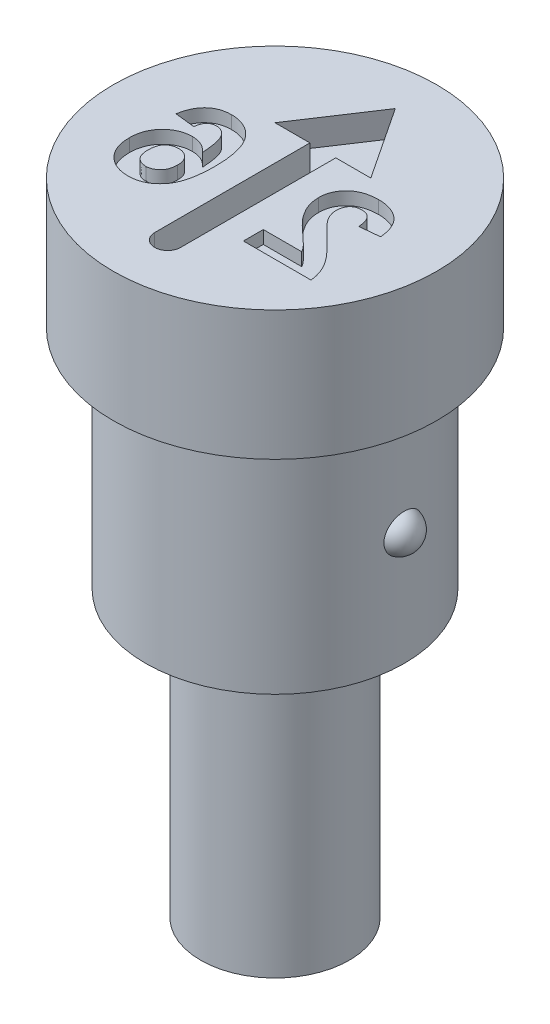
ISO-10303-21;
HEADER;
FILE_DESCRIPTION(('STEP AP214'),'2;1');
FILE_NAME('part.step','',(''),(''),'','','');
FILE_SCHEMA(('AUTOMOTIVE_DESIGN { 1 0 10303 214 1 1 1 1 }'));
ENDSEC;
DATA;
#1=APPLICATION_CONTEXT('core data for automotive mechanical design processes');
#2=APPLICATION_PROTOCOL_DEFINITION('international standard','automotive_design',2000,#1);
#3=PRODUCT_CONTEXT('',#1,'mechanical');
#4=PRODUCT('Part','Part','',(#3));
#5=PRODUCT_RELATED_PRODUCT_CATEGORY('part','',(#4));
#6=PRODUCT_DEFINITION_FORMATION('','',#4);
#7=PRODUCT_DEFINITION_CONTEXT('part definition',#1,'design');
#8=PRODUCT_DEFINITION('design','',#6,#7);
#9=PRODUCT_DEFINITION_SHAPE('','',#8);
#10=(LENGTH_UNIT() NAMED_UNIT(*) SI_UNIT(.MILLI.,.METRE.));
#11=(NAMED_UNIT(*) PLANE_ANGLE_UNIT() SI_UNIT($,.RADIAN.));
#12=(NAMED_UNIT(*) SI_UNIT($,.STERADIAN.) SOLID_ANGLE_UNIT());
#13=UNCERTAINTY_MEASURE_WITH_UNIT(LENGTH_MEASURE(1.E-05),#10,'distance_accuracy_value','');
#14=(GEOMETRIC_REPRESENTATION_CONTEXT(3) GLOBAL_UNCERTAINTY_ASSIGNED_CONTEXT((#13)) GLOBAL_UNIT_ASSIGNED_CONTEXT((#10,
#11,#12)) REPRESENTATION_CONTEXT('',''));
#15=CARTESIAN_POINT('',(0.,0.,0.));
#16=DIRECTION('',(0.,0.,1.));
#17=DIRECTION('',(1.,0.,0.));
#18=AXIS2_PLACEMENT_3D('',#15,#16,#17);
#19=CARTESIAN_POINT('',(0.,0.,0.));
#20=DIRECTION('',(0.,1.,0.));
#21=DIRECTION('',(0.,0.,1.));
#22=AXIS2_PLACEMENT_3D('',#19,#20,#21);
#23=CYLINDRICAL_SURFACE('',#22,2.);
#24=CARTESIAN_POINT('',(0.,-2.,0.));
#25=DIRECTION('',(0.,1.,0.));
#26=DIRECTION('',(0.,0.,1.));
#27=AXIS2_PLACEMENT_3D('',#24,#25,#26);
#28=CIRCLE('',#27,2.);
#29=CARTESIAN_POINT('',(0.,-2.,2.));
#30=VERTEX_POINT('',#29);
#31=EDGE_CURVE('E464',#30,#30,#28,.T.);
#32=ORIENTED_EDGE('',*,*,#31,.F.);
#33=EDGE_LOOP('',(#32));
#34=FACE_BOUND('',#33,.T.);
#35=CARTESIAN_POINT('',(0.,-5.5,0.));
#36=DIRECTION('',(0.,1.,0.));
#37=DIRECTION('',(0.,0.,1.));
#38=AXIS2_PLACEMENT_3D('',#35,#36,#37);
#39=CIRCLE('',#38,2.);
#40=CARTESIAN_POINT('',(0.,-5.5,2.));
#41=VERTEX_POINT('',#40);
#42=EDGE_CURVE('E467',#41,#41,#39,.T.);
#43=ORIENTED_EDGE('',*,*,#42,.T.);
#44=EDGE_LOOP('',(#43));
#45=FACE_BOUND('',#44,.T.);
#46=CARTESIAN_POINT('',(1.97831052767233,-3.75,-0.293747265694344));
#47=CARTESIAN_POINT('',(1.97831078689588,-3.76593641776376,-0.293746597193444));
#48=CARTESIAN_POINT('',(1.97851134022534,-3.78188224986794,-0.29240453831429));
#49=CARTESIAN_POINT('',(1.97929162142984,-3.81332622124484,-0.287074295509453));
#50=CARTESIAN_POINT('',(1.97987172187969,-3.82882390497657,-0.283083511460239));
#51=CARTESIAN_POINT('',(1.98134463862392,-3.85890937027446,-0.27258270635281));
#52=CARTESIAN_POINT('',(1.98223717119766,-3.87349796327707,-0.266074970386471));
#53=CARTESIAN_POINT('',(1.98423542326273,-3.90137759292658,-0.250737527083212));
#54=CARTESIAN_POINT('',(1.98534111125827,-3.91466882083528,-0.24190816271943));
#55=CARTESIAN_POINT('',(1.98765649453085,-3.93973249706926,-0.222085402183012));
#56=CARTESIAN_POINT('',(1.98886711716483,-3.95148847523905,-0.211071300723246));
#57=CARTESIAN_POINT('',(1.9912508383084,-3.97302293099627,-0.187251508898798));
#58=CARTESIAN_POINT('',(1.99242393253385,-3.982801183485,-0.174445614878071));
#59=CARTESIAN_POINT('',(1.99462788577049,-4.00030270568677,-0.147140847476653));
#60=CARTESIAN_POINT('',(1.99565562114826,-4.00798343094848,-0.132614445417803));
#61=CARTESIAN_POINT('',(1.9974297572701,-4.02084909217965,-0.102479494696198));
#62=CARTESIAN_POINT('',(1.99817613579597,-4.0260338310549,-0.0868708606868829));
#63=CARTESIAN_POINT('',(1.99931471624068,-4.03383375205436,-0.0547869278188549));
#64=CARTESIAN_POINT('',(1.99970198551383,-4.03641318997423,-0.0383027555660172));
#65=CARTESIAN_POINT('',(2.00006220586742,-4.03881469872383,-0.00513010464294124));
#66=CARTESIAN_POINT('',(2.0000351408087,-4.03863666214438,0.0115583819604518));
#67=CARTESIAN_POINT('',(1.99956837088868,-4.03551905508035,0.0447599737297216));
#68=CARTESIAN_POINT('',(1.99912646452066,-4.03256475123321,0.0612716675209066));
#69=CARTESIAN_POINT('',(1.99787587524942,-4.02394674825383,0.0935582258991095));
#70=CARTESIAN_POINT('',(1.99706718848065,-4.01828302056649,0.109333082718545));
#71=CARTESIAN_POINT('',(1.99517518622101,-4.00440082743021,0.139666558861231));
#72=CARTESIAN_POINT('',(1.99409233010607,-3.99618663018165,0.154227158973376));
#73=CARTESIAN_POINT('',(1.99177384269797,-3.97741235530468,0.181735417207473));
#74=CARTESIAN_POINT('',(1.9905382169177,-3.96685236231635,0.194683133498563));
#75=CARTESIAN_POINT('',(1.98806834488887,-3.94377921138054,0.218463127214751));
#76=CARTESIAN_POINT('',(1.98683419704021,-3.93128556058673,0.229314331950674));
#77=CARTESIAN_POINT('',(1.98449829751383,-3.90461571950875,0.248721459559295));
#78=CARTESIAN_POINT('',(1.98339653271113,-3.89043969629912,0.257277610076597));
#79=CARTESIAN_POINT('',(1.98147241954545,-3.86107070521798,0.271697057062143));
#80=CARTESIAN_POINT('',(1.98064550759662,-3.84589994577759,0.277604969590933));
#81=CARTESIAN_POINT('',(1.9793410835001,-3.81476131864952,0.286758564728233));
#82=CARTESIAN_POINT('',(1.97886353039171,-3.79879354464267,0.2900045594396));
#83=CARTESIAN_POINT('',(1.97831890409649,-3.76682346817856,0.293696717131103));
#84=CARTESIAN_POINT('',(1.97824458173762,-3.75082698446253,0.294192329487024));
#85=CARTESIAN_POINT('',(1.97849533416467,-3.71898025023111,0.292501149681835));
#86=CARTESIAN_POINT('',(1.97882038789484,-3.70312999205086,0.290314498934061));
#87=CARTESIAN_POINT('',(1.97982953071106,-3.67212862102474,0.283349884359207));
#88=CARTESIAN_POINT('',(1.98051132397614,-3.6569737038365,0.27858848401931));
#89=CARTESIAN_POINT('',(1.98215656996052,-3.62767461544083,0.26662997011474));
#90=CARTESIAN_POINT('',(1.98312003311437,-3.61353048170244,0.25943276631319));
#91=CARTESIAN_POINT('',(1.98523358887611,-3.58649756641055,0.242732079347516));
#92=CARTESIAN_POINT('',(1.98638543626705,-3.57362261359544,0.233206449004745));
#93=CARTESIAN_POINT('',(1.98874294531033,-3.54962508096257,0.212163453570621));
#94=CARTESIAN_POINT('',(1.98994861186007,-3.53850266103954,0.200645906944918));
#95=CARTESIAN_POINT('',(1.99230653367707,-3.51809999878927,0.175710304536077));
#96=CARTESIAN_POINT('',(1.99345736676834,-3.50885813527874,0.162260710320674));
#97=CARTESIAN_POINT('',(1.99555554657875,-3.49271435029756,0.134009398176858));
#98=CARTESIAN_POINT('',(1.99650287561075,-3.48581263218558,0.119207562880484));
#99=CARTESIAN_POINT('',(1.99810519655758,-3.47442614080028,0.0884132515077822));
#100=CARTESIAN_POINT('',(1.99875521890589,-3.46998221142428,0.0724054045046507));
#101=CARTESIAN_POINT('',(1.99966888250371,-3.46379408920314,0.0398652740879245));
#102=CARTESIAN_POINT('',(1.99993250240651,-3.46205004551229,0.0233329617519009));
#103=CARTESIAN_POINT('',(2.00004504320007,-3.46130149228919,-0.0099295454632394));
#104=CARTESIAN_POINT('',(1.99989058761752,-3.46231928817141,-0.0266602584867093));
#105=CARTESIAN_POINT('',(1.99917677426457,-3.46711715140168,-0.0597123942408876));
#106=CARTESIAN_POINT('',(1.99861740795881,-3.47089727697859,-0.0760338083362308));
#107=CARTESIAN_POINT('',(1.997155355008,-3.48112937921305,-0.107814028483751));
#108=CARTESIAN_POINT('',(1.9962524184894,-3.48758330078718,-0.12327219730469));
#109=CARTESIAN_POINT('',(1.99420468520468,-3.5029991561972,-0.152865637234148));
#110=CARTESIAN_POINT('',(1.99305989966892,-3.5119609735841,-0.16700096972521));
#111=CARTESIAN_POINT('',(1.9906669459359,-3.53209122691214,-0.19344378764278));
#112=CARTESIAN_POINT('',(1.98941951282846,-3.54324465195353,-0.205762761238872));
#113=CARTESIAN_POINT('',(1.98695768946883,-3.56749944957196,-0.228315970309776));
#114=CARTESIAN_POINT('',(1.98574330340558,-3.5806010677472,-0.23854994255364));
#115=CARTESIAN_POINT('',(1.98350679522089,-3.60817756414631,-0.25647901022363));
#116=CARTESIAN_POINT('',(1.9824821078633,-3.6226294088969,-0.264209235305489));
#117=CARTESIAN_POINT('',(1.98072359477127,-3.65264613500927,-0.277086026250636));
#118=CARTESIAN_POINT('',(1.97998943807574,-3.66820972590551,-0.282235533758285));
#119=CARTESIAN_POINT('',(1.97907239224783,-3.69487781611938,-0.288580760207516));
#120=CARTESIAN_POINT('',(1.97878817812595,-3.70580886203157,-0.290515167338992));
#121=CARTESIAN_POINT('',(1.97840715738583,-3.72782508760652,-0.293098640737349));
#122=CARTESIAN_POINT('',(1.97831034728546,-3.73891026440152,-0.293747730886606));
#123=CARTESIAN_POINT('',(1.97831052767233,-3.75,-0.293747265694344));
#124=B_SPLINE_CURVE_WITH_KNOTS('',3,(#46,#47,#48,#49,#50,#51,#52,#53,#54,#55,#56,#57,#58,#59,
#60,#61,#62,#63,#64,#65,#66,#67,#68,#69,#70,#71,#72,#73,#74,#75,#76,#77,#78,#79,#80,#81,#82,#83,
#84,#85,#86,#87,#88,#89,#90,#91,#92,#93,#94,#95,#96,#97,#98,#99,#100,#101,#102,#103,#104,#105,
#106,#107,#108,#109,#110,#111,#112,#113,#114,#115,#116,#117,#118,#119,#120,#121,#122,#123),
.UNSPECIFIED.,.T.,.F.,(4,2,2,2,2,2,2,2,2,2,2,2,2,2,2,2,2,2,2,2,2,2,2,2,2,2,2,2,2,2,2,2,2,2,2,2,
2,2,4),(0.,0.0477684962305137,0.0955839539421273,0.143356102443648,0.191121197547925,
0.239362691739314,0.287609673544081,0.336772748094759,0.385939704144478,0.435772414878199,
0.485607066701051,0.535707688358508,0.585808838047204,0.635826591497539,0.685842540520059,
0.735383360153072,0.784919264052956,0.833585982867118,0.882246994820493,0.930030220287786,
0.977810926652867,1.02528785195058,1.072766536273,1.12071570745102,1.16866925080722,
1.21752038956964,1.26637577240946,1.31602035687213,1.36566768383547,1.41571716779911,
1.46576770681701,1.51585471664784,1.56593940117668,1.61569230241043,1.6654514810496,
1.71447876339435,1.76345003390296,1.79669149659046,1.82993234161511),.UNSPECIFIED.);
#125=CARTESIAN_POINT('',(1.97831052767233,-3.75,-0.293747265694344));
#126=VERTEX_POINT('',#125);
#127=EDGE_CURVE('E41',#126,#126,#124,.T.);
#128=ORIENTED_EDGE('',*,*,#127,.T.);
#129=EDGE_LOOP('',(#128));
#130=FACE_BOUND('',#129,.T.);
#131=ADVANCED_FACE('F37',(#34,#45,#130),#23,.T.);
#132=CARTESIAN_POINT('',(0.,0.,0.));
#133=DIRECTION('',(0.,1.,0.));
#134=DIRECTION('',(0.,0.,1.));
#135=AXIS2_PLACEMENT_3D('',#132,#133,#134);
#136=PLANE('',#135);
#137=DIRECTION('',(-1.,0.,0.));
#138=VECTOR('',#137,1.);
#139=CARTESIAN_POINT('',(1.19363792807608,0.,0.780287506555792));
#140=LINE('',#139,#138);
#141=CARTESIAN_POINT('',(1.19363792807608,0.,0.780287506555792));
#142=VERTEX_POINT('',#141);
#143=CARTESIAN_POINT('',(0.599086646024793,0.,0.780287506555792));
#144=VERTEX_POINT('',#143);
#145=EDGE_CURVE('E58',#142,#144,#140,.T.);
#146=ORIENTED_EDGE('',*,*,#145,.F.);
#147=CARTESIAN_POINT('',(0.754214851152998,0.,0.324518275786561));
#148=CARTESIAN_POINT('',(0.75908140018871,0.,0.330647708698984));
#149=CARTESIAN_POINT('',(0.769504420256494,0.,0.343775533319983));
#150=CARTESIAN_POINT('',(0.78723671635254,0.,0.363905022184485));
#151=CARTESIAN_POINT('',(0.807786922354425,0.,0.385892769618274));
#152=CARTESIAN_POINT('',(0.830864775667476,0.,0.410150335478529));
#153=CARTESIAN_POINT('',(0.857232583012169,0.,0.435818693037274));
#154=CARTESIAN_POINT('',(0.885941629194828,0.,0.463971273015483));
#155=CARTESIAN_POINT('',(0.918255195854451,0.,0.493167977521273));
#156=CARTESIAN_POINT('',(0.951724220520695,0.,0.524137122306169));
#157=CARTESIAN_POINT('',(0.985338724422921,0.,0.554278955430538));
#158=CARTESIAN_POINT('',(1.01623529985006,0.,0.582907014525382));
#159=CARTESIAN_POINT('',(1.04429967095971,0.,0.608236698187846));
#160=CARTESIAN_POINT('',(1.06822482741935,0.,0.631666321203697));
#161=CARTESIAN_POINT('',(1.08941804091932,0.,0.651596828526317));
#162=CARTESIAN_POINT('',(1.10711543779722,0.,0.669050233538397));
#163=CARTESIAN_POINT('',(1.12164817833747,0.,0.683604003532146));
#164=CARTESIAN_POINT('',(1.14167335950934,0.,0.706289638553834));
#165=CARTESIAN_POINT('',(1.1671531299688,0.,0.73697196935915));
#166=CARTESIAN_POINT('',(1.18507919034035,0.,0.766289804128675));
#167=CARTESIAN_POINT('',(1.19363792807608,0.,0.780287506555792));
#168=B_SPLINE_CURVE_WITH_KNOTS('',3,(#147,#148,#149,#150,#151,#152,#153,#154,#155,#156,#157,
#158,#159,#160,#161,#162,#163,#164,#165,#166,#167),.UNSPECIFIED.,.F.,.F.,(4,1,1,1,1,1,1,1,1,1,1,
1,1,1,1,1,1,1,4),(0.,0.0369753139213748,0.0791925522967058,0.126700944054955,0.17918407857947,
0.23736864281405,0.300558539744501,0.369153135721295,0.443112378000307,0.516018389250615,
0.582473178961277,0.642136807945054,0.694619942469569,0.740679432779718,0.779589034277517,
0.812073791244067,0.837814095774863,0.922564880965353,1.),.UNSPECIFIED.);
#169=CARTESIAN_POINT('',(0.754214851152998,0.,0.324518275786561));
#170=VERTEX_POINT('',#169);
#171=EDGE_CURVE('E279',#170,#142,#168,.T.);
#172=ORIENTED_EDGE('',*,*,#171,.F.);
#173=CARTESIAN_POINT('',(0.599086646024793,0.,-0.0767637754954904));
#174=CARTESIAN_POINT('',(0.599478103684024,0.,-0.0593230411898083));
#175=CARTESIAN_POINT('',(0.600254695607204,0.,-0.0247233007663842));
#176=CARTESIAN_POINT('',(0.607689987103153,0.,0.0264254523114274));
#177=CARTESIAN_POINT('',(0.619049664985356,0.,0.0763947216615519));
#178=CARTESIAN_POINT('',(0.635838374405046,0.,0.125306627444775));
#179=CARTESIAN_POINT('',(0.657119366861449,0.,0.174334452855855));
#180=CARTESIAN_POINT('',(0.68455107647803,0.,0.223588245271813));
#181=CARTESIAN_POINT('',(0.716401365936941,0.,0.274553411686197));
#182=CARTESIAN_POINT('',(0.741338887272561,0.,0.307504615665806));
#183=CARTESIAN_POINT('',(0.754214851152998,0.,0.324518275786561));
#184=B_SPLINE_CURVE_WITH_KNOTS('',3,(#173,#174,#175,#176,#177,#178,#179,#180,#181,#182,#183),
.UNSPECIFIED.,.F.,.F.,(4,1,1,1,1,1,1,1,4),(0.,0.119176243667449,0.236427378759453,
0.352663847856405,0.469086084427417,0.589462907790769,0.717601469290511,0.854189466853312,1.),.UNSPECIFIED.);
#185=CARTESIAN_POINT('',(0.599086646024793,0.,-0.0767637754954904));
#186=VERTEX_POINT('',#185);
#187=EDGE_CURVE('E282',#186,#170,#184,.T.);
#188=ORIENTED_EDGE('',*,*,#187,.F.);
#189=CARTESIAN_POINT('',(1.09011228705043,0.,-0.512020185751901));
#190=CARTESIAN_POINT('',(1.07150877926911,0.,-0.511662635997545));
#191=CARTESIAN_POINT('',(1.03527611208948,0.,-0.510966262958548));
#192=CARTESIAN_POINT('',(0.982382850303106,0.,-0.505215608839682));
#193=CARTESIAN_POINT('',(0.932693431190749,0.,-0.495188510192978));
#194=CARTESIAN_POINT('',(0.885773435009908,0.,-0.481906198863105));
#195=CARTESIAN_POINT('',(0.84210470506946,0.,-0.464173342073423));
#196=CARTESIAN_POINT('',(0.801323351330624,0.,-0.442735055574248));
#197=CARTESIAN_POINT('',(0.764071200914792,0.,-0.416777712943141));
#198=CARTESIAN_POINT('',(0.729792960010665,0.,-0.387716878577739));
#199=CARTESIAN_POINT('',(0.699150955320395,0.,-0.355759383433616));
#200=CARTESIAN_POINT('',(0.672311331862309,0.,-0.321671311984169));
#201=CARTESIAN_POINT('',(0.649825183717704,0.,-0.285476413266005));
#202=CARTESIAN_POINT('',(0.630955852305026,0.,-0.247615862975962));
#203=CARTESIAN_POINT('',(0.616945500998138,0.,-0.207480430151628));
#204=CARTESIAN_POINT('',(0.606736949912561,0.,-0.165625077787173));
#205=CARTESIAN_POINT('',(0.599968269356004,0.,-0.121854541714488));
#206=CARTESIAN_POINT('',(0.599383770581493,0.,-0.0919602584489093));
#207=CARTESIAN_POINT('',(0.599086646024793,0.,-0.0767637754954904));
#208=B_SPLINE_CURVE_WITH_KNOTS('',3,(#189,#190,#191,#192,#193,#194,#195,#196,#197,#198,#199,
#200,#201,#202,#203,#204,#205,#206,#207),.UNSPECIFIED.,.F.,.F.,(4,1,1,1,1,1,1,1,1,1,1,1,1,1,1,1,
4),(0.,0.0756723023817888,0.147381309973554,0.216084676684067,0.28169803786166,
0.345459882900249,0.407485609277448,0.46873129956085,0.529782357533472,0.590032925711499,
0.648548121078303,0.70595351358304,0.763101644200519,0.820289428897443,0.878479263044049,
0.938226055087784,1.),.UNSPECIFIED.);
#209=CARTESIAN_POINT('',(1.09011228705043,0.,-0.512020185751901));
#210=VERTEX_POINT('',#209);
#211=EDGE_CURVE('E1223',#210,#186,#208,.T.);
#212=ORIENTED_EDGE('',*,*,#211,.F.);
#213=CARTESIAN_POINT('',(1.604214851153,0.,-0.0293278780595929));
#214=CARTESIAN_POINT('',(1.60174105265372,0.,-0.0501009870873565));
#215=CARTESIAN_POINT('',(1.59694475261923,0.,-0.0903767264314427));
#216=CARTESIAN_POINT('',(1.58497550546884,0.,-0.148226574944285));
#217=CARTESIAN_POINT('',(1.56981689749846,0.,-0.201595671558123));
#218=CARTESIAN_POINT('',(1.55074626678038,0.,-0.250384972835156));
#219=CARTESIAN_POINT('',(1.52855182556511,0.,-0.294904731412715));
#220=CARTESIAN_POINT('',(1.5021014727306,0.,-0.334486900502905));
#221=CARTESIAN_POINT('',(1.47231941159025,0.,-0.369569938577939));
#222=CARTESIAN_POINT('',(1.43917990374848,0.,-0.400135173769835));
#223=CARTESIAN_POINT('',(1.40289362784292,0.,-0.426279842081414));
#224=CARTESIAN_POINT('',(1.36481769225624,0.,-0.449617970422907));
#225=CARTESIAN_POINT('',(1.3242079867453,0.,-0.468762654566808));
#226=CARTESIAN_POINT('',(1.28151162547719,0.,-0.484540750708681));
#227=CARTESIAN_POINT('',(1.23674790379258,0.,-0.49715047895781));
#228=CARTESIAN_POINT('',(1.18970978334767,0.,-0.505487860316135));
#229=CARTESIAN_POINT('',(1.14068756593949,0.,-0.511352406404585));
#230=CARTESIAN_POINT('',(1.10722479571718,0.,-0.511794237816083));
#231=CARTESIAN_POINT('',(1.09011228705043,0.,-0.512020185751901));
#232=B_SPLINE_CURVE_WITH_KNOTS('',3,(#213,#214,#215,#216,#217,#218,#219,#220,#221,#222,#223,
#224,#225,#226,#227,#228,#229,#230,#231),.UNSPECIFIED.,.F.,.F.,(4,1,1,1,1,1,1,1,1,1,1,1,1,1,1,1,
4),(0.,0.0794357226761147,0.154013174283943,0.224141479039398,0.289934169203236,
0.352732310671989,0.41272577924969,0.470302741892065,0.527168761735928,0.583502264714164,
0.639948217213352,0.696584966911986,0.753726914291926,0.812707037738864,0.872963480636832,
0.93503486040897,1.),.UNSPECIFIED.);
#233=CARTESIAN_POINT('',(1.604214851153,0.,-0.0293278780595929));
#234=VERTEX_POINT('',#233);
#235=EDGE_CURVE('E1218',#234,#210,#232,.T.);
#236=ORIENTED_EDGE('',*,*,#235,.F.);
#237=DIRECTION('',(0.995240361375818,0.,-0.0974506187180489));
#238=VECTOR('',#237,1.);
#239=CARTESIAN_POINT('',(1.29652254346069,0.,0.00080032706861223));
#240=LINE('',#239,#238);
#241=CARTESIAN_POINT('',(1.29652254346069,0.,0.00080032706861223));
#242=VERTEX_POINT('',#241);
#243=EDGE_CURVE('E1212',#242,#234,#240,.T.);
#244=ORIENTED_EDGE('',*,*,#243,.F.);
#245=CARTESIAN_POINT('',(1.09652254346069,0.,-0.245353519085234));
#246=CARTESIAN_POINT('',(1.11047812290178,0.,-0.244721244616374));
#247=CARTESIAN_POINT('',(1.13743728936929,0.,-0.243499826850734));
#248=CARTESIAN_POINT('',(1.17575211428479,0.,-0.232829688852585));
#249=CARTESIAN_POINT('',(1.20927051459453,0.,-0.214358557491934));
#250=CARTESIAN_POINT('',(1.23315750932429,0.,-0.193308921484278));
#251=CARTESIAN_POINT('',(1.24929430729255,0.,-0.172839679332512));
#252=CARTESIAN_POINT('',(1.26028935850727,0.,-0.155002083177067));
#253=CARTESIAN_POINT('',(1.26976623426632,0.,-0.134733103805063));
#254=CARTESIAN_POINT('',(1.27816353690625,0.,-0.112260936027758));
#255=CARTESIAN_POINT('',(1.2847964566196,0.,-0.0873281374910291));
#256=CARTESIAN_POINT('',(1.29013819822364,0.,-0.0601245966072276));
#257=CARTESIAN_POINT('',(1.29444286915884,0.,-0.0305039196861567));
#258=CARTESIAN_POINT('',(1.29581183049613,0.,-0.00989766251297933));
#259=CARTESIAN_POINT('',(1.29652254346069,0.,0.00080032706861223));
#260=B_SPLINE_CURVE_WITH_KNOTS('',3,(#245,#246,#247,#248,#249,#250,#251,#252,#253,#254,#255,
#256,#257,#258,#259),.UNSPECIFIED.,.F.,.F.,(4,1,1,1,1,1,1,1,1,1,1,1,4),(0.,0.116899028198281,
0.225823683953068,0.330086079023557,0.435451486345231,0.490306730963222,0.548244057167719,
0.610766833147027,0.677675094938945,0.749188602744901,0.826858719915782,0.910111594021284,1.),.UNSPECIFIED.);
#261=CARTESIAN_POINT('',(1.09652254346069,0.,-0.245353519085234));
#262=VERTEX_POINT('',#261);
#263=EDGE_CURVE('E1204',#262,#242,#260,.T.);
#264=ORIENTED_EDGE('',*,*,#263,.F.);
#265=CARTESIAN_POINT('',(0.9067789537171,0.,-0.0354176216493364));
#266=CARTESIAN_POINT('',(0.907355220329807,0.,-0.0513814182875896));
#267=CARTESIAN_POINT('',(0.908445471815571,0.,-0.0815836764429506));
#268=CARTESIAN_POINT('',(0.917587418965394,0.,-0.12420464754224));
#269=CARTESIAN_POINT('',(0.933799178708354,0.,-0.160843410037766));
#270=CARTESIAN_POINT('',(0.956119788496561,0.,-0.191612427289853));
#271=CARTESIAN_POINT('',(0.984344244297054,0.,-0.215719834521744));
#272=CARTESIAN_POINT('',(1.0173394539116,0.,-0.233532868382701));
#273=CARTESIAN_POINT('',(1.0555884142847,0.,-0.243381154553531));
#274=CARTESIAN_POINT('',(1.08247204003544,0.,-0.244676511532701));
#275=CARTESIAN_POINT('',(1.09652254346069,0.,-0.245353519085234));
#276=B_SPLINE_CURVE_WITH_KNOTS('',3,(#265,#266,#267,#268,#269,#270,#271,#272,#273,#274,#275),
.UNSPECIFIED.,.F.,.F.,(4,1,1,1,1,1,1,1,4),(0.,0.149140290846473,0.282161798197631,
0.404655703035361,0.521109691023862,0.634416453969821,0.748796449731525,0.868710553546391,1.),.UNSPECIFIED.);
#277=CARTESIAN_POINT('',(0.9067789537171,0.,-0.0354176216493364));
#278=VERTEX_POINT('',#277);
#279=EDGE_CURVE('E1196',#278,#262,#276,.T.);
#280=ORIENTED_EDGE('',*,*,#279,.F.);
#281=CARTESIAN_POINT('',(0.967676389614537,0.,0.149518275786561));
#282=CARTESIAN_POINT('',(0.958412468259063,0.,0.13412991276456));
#283=CARTESIAN_POINT('',(0.940543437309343,0.,0.10444754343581));
#284=CARTESIAN_POINT('',(0.920948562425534,0.,0.0577714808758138));
#285=CARTESIAN_POINT('',(0.909186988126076,0.,0.0111050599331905));
#286=CARTESIAN_POINT('',(0.90757298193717,0.,-0.0200771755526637));
#287=CARTESIAN_POINT('',(0.9067789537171,0.,-0.0354176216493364));
#288=B_SPLINE_CURVE_WITH_KNOTS('',3,(#281,#282,#283,#284,#285,#286,#287),.UNSPECIFIED.,.F.,.F.,
(4,1,1,1,4),(0.,0.272795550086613,0.526191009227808,0.766904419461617,1.),.UNSPECIFIED.);
#289=CARTESIAN_POINT('',(0.967676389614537,0.,0.149518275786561));
#290=VERTEX_POINT('',#289);
#291=EDGE_CURVE('E1188',#290,#278,#288,.T.);
#292=ORIENTED_EDGE('',*,*,#291,.F.);
#293=CARTESIAN_POINT('',(1.21254818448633,0.,0.407851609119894));
#294=CARTESIAN_POINT('',(1.19672893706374,0.,0.392581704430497));
#295=CARTESIAN_POINT('',(1.16661374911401,0.,0.363512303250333));
#296=CARTESIAN_POINT('',(1.12372966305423,0.,0.321886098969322));
#297=CARTESIAN_POINT('',(1.0860301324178,0.,0.283619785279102));
#298=CARTESIAN_POINT('',(1.0527269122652,0.,0.249705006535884));
#299=CARTESIAN_POINT('',(1.02458935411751,0.,0.21927820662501));
#300=CARTESIAN_POINT('',(1.00124733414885,0.,0.19281723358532));
#301=CARTESIAN_POINT('',(0.982405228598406,0.,0.170214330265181));
#302=CARTESIAN_POINT('',(0.972200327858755,0.,0.155875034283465));
#303=CARTESIAN_POINT('',(0.967676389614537,0.,0.149518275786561));
#304=B_SPLINE_CURVE_WITH_KNOTS('',3,(#293,#294,#295,#296,#297,#298,#299,#300,#301,#302,#303),
.UNSPECIFIED.,.F.,.F.,(4,1,1,1,1,1,1,1,4),(0.,0.18509006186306,0.352356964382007,
0.503079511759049,0.637279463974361,0.752473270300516,0.851885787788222,0.934339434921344,1.),.UNSPECIFIED.);
#305=CARTESIAN_POINT('',(1.21254818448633,0.,0.407851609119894));
#306=VERTEX_POINT('',#305);
#307=EDGE_CURVE('E1180',#306,#290,#304,.T.);
#308=ORIENTED_EDGE('',*,*,#307,.F.);
#309=CARTESIAN_POINT('',(1.64524049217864,0.,1.0879798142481));
#310=CARTESIAN_POINT('',(1.64169845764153,0.,1.0616830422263));
#311=CARTESIAN_POINT('',(1.63461637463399,0.,1.00910424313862));
#312=CARTESIAN_POINT('',(1.6127211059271,0.,0.932299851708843));
#313=CARTESIAN_POINT('',(1.58349842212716,0.,0.857351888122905));
#314=CARTESIAN_POINT('',(1.55178274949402,0.,0.79636243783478));
#315=CARTESIAN_POINT('',(1.52023800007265,0.,0.747268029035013));
#316=CARTESIAN_POINT('',(1.49161744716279,0.,0.707039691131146));
#317=CARTESIAN_POINT('',(1.45747417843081,0.,0.664238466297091));
#318=CARTESIAN_POINT('',(1.4183036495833,0.,0.618518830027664));
#319=CARTESIAN_POINT('',(1.37432233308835,0.,0.569737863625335));
#320=CARTESIAN_POINT('',(1.32520209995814,0.,0.518076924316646));
#321=CARTESIAN_POINT('',(1.27070863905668,0.,0.463783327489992));
#322=CARTESIAN_POINT('',(1.23237151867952,0.,0.426915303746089));
#323=CARTESIAN_POINT('',(1.21254818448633,0.,0.407851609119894));
#324=B_SPLINE_CURVE_WITH_KNOTS('',3,(#309,#310,#311,#312,#313,#314,#315,#316,#317,#318,#319,
#320,#321,#322,#323),.UNSPECIFIED.,.F.,.F.,(4,1,1,1,1,1,1,1,1,1,1,1,4),(0.,0.0963574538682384,
0.192660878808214,0.289454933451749,0.388479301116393,0.441921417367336,0.501521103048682,
0.567882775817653,0.640891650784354,0.72037065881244,0.806636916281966,0.900015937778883,1.),.UNSPECIFIED.);
#325=CARTESIAN_POINT('',(1.64524049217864,0.,1.0879798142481));
#326=VERTEX_POINT('',#325);
#327=EDGE_CURVE('E1175',#326,#306,#324,.T.);
#328=ORIENTED_EDGE('',*,*,#327,.F.);
#329=DIRECTION('',(1.,0.,0.));
#330=VECTOR('',#329,1.);
#331=CARTESIAN_POINT('',(0.599086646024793,0.,1.0879798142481));
#332=LINE('',#331,#330);
#333=CARTESIAN_POINT('',(0.599086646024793,0.,1.0879798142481));
#334=VERTEX_POINT('',#333);
#335=EDGE_CURVE('E1172',#334,#326,#332,.T.);
#336=ORIENTED_EDGE('',*,*,#335,.F.);
#337=DIRECTION('',(0.,0.,1.));
#338=VECTOR('',#337,1.);
#339=CARTESIAN_POINT('',(0.599086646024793,0.,0.780287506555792));
#340=LINE('',#339,#338);
#341=EDGE_CURVE('E1170',#144,#334,#340,.T.);
#342=ORIENTED_EDGE('',*,*,#341,.F.);
#343=EDGE_LOOP('',(#146,#172,#188,#212,#236,#244,#264,#280,#292,#308,#328,#336,#342));
#344=FACE_BOUND('',#343,.T.);
#345=CARTESIAN_POINT('',(-1.18540053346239,0.,-0.512020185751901));
#346=CARTESIAN_POINT('',(-1.19984096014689,0.,-0.511760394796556));
#347=CARTESIAN_POINT('',(-1.22807014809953,0.,-0.511252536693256));
#348=CARTESIAN_POINT('',(-1.26944408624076,0.,-0.505859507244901));
#349=CARTESIAN_POINT('',(-1.30891443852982,0.,-0.497612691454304));
#350=CARTESIAN_POINT('',(-1.34658465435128,0.,-0.486197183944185));
#351=CARTESIAN_POINT('',(-1.38218950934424,0.,-0.47090961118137));
#352=CARTESIAN_POINT('',(-1.41587039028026,0.,-0.452285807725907));
#353=CARTESIAN_POINT('',(-1.44774052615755,0.,-0.430376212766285));
#354=CARTESIAN_POINT('',(-1.47763409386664,0.,-0.405321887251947));
#355=CARTESIAN_POINT('',(-1.50531050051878,0.,-0.377047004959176));
#356=CARTESIAN_POINT('',(-1.53030165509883,0.,-0.345487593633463));
#357=CARTESIAN_POINT('',(-1.55277306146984,0.,-0.311024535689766));
#358=CARTESIAN_POINT('',(-1.57282306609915,0.,-0.273686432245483));
#359=CARTESIAN_POINT('',(-1.589640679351,0.,-0.233115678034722));
#360=CARTESIAN_POINT('',(-1.6040981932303,0.,-0.189631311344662));
#361=CARTESIAN_POINT('',(-1.6159884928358,0.,-0.143139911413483));
#362=CARTESIAN_POINT('',(-1.62162162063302,0.,-0.110889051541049));
#363=CARTESIAN_POINT('',(-1.62450309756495,0.,-0.0943919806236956));
#364=B_SPLINE_CURVE_WITH_KNOTS('',3,(#345,#346,#347,#348,#349,#350,#351,#352,#353,#354,#355,
#356,#357,#358,#359,#360,#361,#362,#363),.UNSPECIFIED.,.F.,.F.,(4,1,1,1,1,1,1,1,1,1,1,1,1,1,1,1,
4),(0.,0.0647517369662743,0.126581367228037,0.186839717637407,0.245514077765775,
0.302849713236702,0.360345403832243,0.417912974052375,0.476091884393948,0.535068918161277,
0.595103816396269,0.656390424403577,0.719434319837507,0.784953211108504,0.853160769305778,
0.924888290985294,1.),.UNSPECIFIED.);
#365=CARTESIAN_POINT('',(-1.18540053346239,0.,-0.512020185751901));
#366=VERTEX_POINT('',#365);
#367=CARTESIAN_POINT('',(-1.62450309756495,0.,-0.0943919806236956));
#368=VERTEX_POINT('',#367);
#369=EDGE_CURVE('E66',#366,#368,#364,.T.);
#370=ORIENTED_EDGE('',*,*,#369,.F.);
#371=CARTESIAN_POINT('',(-0.619374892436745,0.,0.309454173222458));
#372=CARTESIAN_POINT('',(-0.619853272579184,0.,0.274397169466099));
#373=CARTESIAN_POINT('',(-0.620777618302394,0.,0.20665858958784));
#374=CARTESIAN_POINT('',(-0.628215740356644,0.,0.108853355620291));
#375=CARTESIAN_POINT('',(-0.64003054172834,0.,0.0185343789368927));
#376=CARTESIAN_POINT('',(-0.657241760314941,0.,-0.0640946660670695));
#377=CARTESIAN_POINT('',(-0.679256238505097,0.,-0.139205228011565));
#378=CARTESIAN_POINT('',(-0.705945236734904,0.,-0.206948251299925));
#379=CARTESIAN_POINT('',(-0.737979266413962,0.,-0.26707848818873));
#380=CARTESIAN_POINT('',(-0.775223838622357,0.,-0.319400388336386));
#381=CARTESIAN_POINT('',(-0.816203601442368,0.,-0.364881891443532));
#382=CARTESIAN_POINT('',(-0.860236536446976,0.,-0.404140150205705));
#383=CARTESIAN_POINT('',(-0.907154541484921,0.,-0.437554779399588));
#384=CARTESIAN_POINT('',(-0.956956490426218,0.,-0.465041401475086));
#385=CARTESIAN_POINT('',(-1.01005121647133,0.,-0.485878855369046));
#386=CARTESIAN_POINT('',(-1.06593509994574,0.,-0.500926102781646));
#387=CARTESIAN_POINT('',(-1.1247020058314,0.,-0.510596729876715));
#388=CARTESIAN_POINT('',(-1.16495640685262,0.,-0.511540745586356));
#389=CARTESIAN_POINT('',(-1.18540053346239,0.,-0.512020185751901));
#390=B_SPLINE_CURVE_WITH_KNOTS('',3,(#371,#372,#373,#374,#375,#376,#377,#378,#379,#380,#381,
#382,#383,#384,#385,#386,#387,#388,#389),.UNSPECIFIED.,.F.,.F.,(4,1,1,1,1,1,1,1,1,1,1,1,1,1,1,1,
4),(0.,0.0932311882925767,0.180145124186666,0.260720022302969,0.335343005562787,
0.40439372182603,0.46866345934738,0.528671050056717,0.585123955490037,0.639046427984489,
0.691174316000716,0.741714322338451,0.791946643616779,0.84207517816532,0.893016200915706,
0.945665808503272,1.),.UNSPECIFIED.);
#391=CARTESIAN_POINT('',(-0.619374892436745,0.,0.309454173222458));
#392=VERTEX_POINT('',#391);
#393=EDGE_CURVE('E386',#392,#366,#390,.T.);
#394=ORIENTED_EDGE('',*,*,#393,.F.);
#395=CARTESIAN_POINT('',(-1.16232361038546,0.,1.10849263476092));
#396=CARTESIAN_POINT('',(-1.1429545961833,0.,1.10795074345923));
#397=CARTESIAN_POINT('',(-1.10487166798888,0.,1.10688528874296));
#398=CARTESIAN_POINT('',(-1.04912249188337,0.,1.09811713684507));
#399=CARTESIAN_POINT('',(-0.996120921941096,0.,1.08328281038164));
#400=CARTESIAN_POINT('',(-0.945873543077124,0.,1.06256604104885));
#401=CARTESIAN_POINT('',(-0.897962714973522,0.,1.03650755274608));
#402=CARTESIAN_POINT('',(-0.852833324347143,0.,1.00413815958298));
#403=CARTESIAN_POINT('',(-0.810604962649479,0.,0.965766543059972));
#404=CARTESIAN_POINT('',(-0.770719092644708,0.,0.921912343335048));
#405=CARTESIAN_POINT('',(-0.734424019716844,0.,0.871257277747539));
#406=CARTESIAN_POINT('',(-0.703514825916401,0.,0.812710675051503));
#407=CARTESIAN_POINT('',(-0.677300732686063,0.,0.746913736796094));
#408=CARTESIAN_POINT('',(-0.655958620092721,0.,0.673697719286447));
#409=CARTESIAN_POINT('',(-0.639484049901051,0.,0.593068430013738));
#410=CARTESIAN_POINT('',(-0.627988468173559,0.,0.505019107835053));
#411=CARTESIAN_POINT('',(-0.620353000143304,0.,0.409695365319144));
#412=CARTESIAN_POINT('',(-0.619708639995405,0.,0.343658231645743));
#413=CARTESIAN_POINT('',(-0.619374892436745,0.,0.309454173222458));
#414=B_SPLINE_CURVE_WITH_KNOTS('',3,(#395,#396,#397,#398,#399,#400,#401,#402,#403,#404,#405,
#406,#407,#408,#409,#410,#411,#412,#413),.UNSPECIFIED.,.F.,.F.,(4,1,1,1,1,1,1,1,1,1,1,1,1,1,1,1,
4),(0.,0.0532594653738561,0.104717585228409,0.154775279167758,0.204330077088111,
0.25391362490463,0.304476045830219,0.356706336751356,0.41059695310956,0.467274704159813,
0.52762561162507,0.59224090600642,0.661798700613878,0.737130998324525,0.818387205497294,
0.905933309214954,1.),.UNSPECIFIED.);
#415=CARTESIAN_POINT('',(-1.16232361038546,0.,1.10849263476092));
#416=VERTEX_POINT('',#415);
#417=EDGE_CURVE('E558',#416,#392,#414,.T.);
#418=ORIENTED_EDGE('',*,*,#417,.F.);
#419=CARTESIAN_POINT('',(-1.66552873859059,0.,0.586697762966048));
#420=CARTESIAN_POINT('',(-1.66508461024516,0.,0.605944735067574));
#421=CARTESIAN_POINT('',(-1.66421845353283,0.,0.643480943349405));
#422=CARTESIAN_POINT('',(-1.65784293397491,0.,0.698453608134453));
#423=CARTESIAN_POINT('',(-1.64658105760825,0.,0.750341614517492));
#424=CARTESIAN_POINT('',(-1.63119490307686,0.,0.799561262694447));
#425=CARTESIAN_POINT('',(-1.61129335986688,0.,0.845722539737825));
#426=CARTESIAN_POINT('',(-1.5871842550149,0.,0.889205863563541));
#427=CARTESIAN_POINT('',(-1.55805171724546,0.,0.929268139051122));
#428=CARTESIAN_POINT('',(-1.52521784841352,0.,0.966448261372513));
#429=CARTESIAN_POINT('',(-1.48861458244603,0.,0.999626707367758));
#430=CARTESIAN_POINT('',(-1.44960589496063,0.,1.02900661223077));
#431=CARTESIAN_POINT('',(-1.40775912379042,0.,1.05342926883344));
#432=CARTESIAN_POINT('',(-1.36369281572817,0.,1.07398511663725));
#433=CARTESIAN_POINT('',(-1.31665010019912,0.,1.08907041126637));
#434=CARTESIAN_POINT('',(-1.26746033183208,0.,1.10038362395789));
#435=CARTESIAN_POINT('',(-1.21572353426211,0.,1.10728367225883));
#436=CARTESIAN_POINT('',(-1.18040047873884,0.,1.10808337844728));
#437=CARTESIAN_POINT('',(-1.16232361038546,0.,1.10849263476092));
#438=B_SPLINE_CURVE_WITH_KNOTS('',3,(#419,#420,#421,#422,#423,#424,#425,#426,#427,#428,#429,
#430,#431,#432,#433,#434,#435,#436,#437),.UNSPECIFIED.,.F.,.F.,(4,1,1,1,1,1,1,1,1,1,1,1,1,1,1,1,
4),(0.,0.0708046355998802,0.13808600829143,0.203231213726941,0.265884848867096,
0.327509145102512,0.387868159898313,0.448411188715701,0.509386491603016,0.570040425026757,
0.629864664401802,0.68871511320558,0.747985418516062,0.80839432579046,0.870086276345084,
0.933515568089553,1.),.UNSPECIFIED.);
#439=CARTESIAN_POINT('',(-1.66552873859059,0.,0.586697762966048));
#440=VERTEX_POINT('',#439);
#441=EDGE_CURVE('E566',#440,#416,#438,.T.);
#442=ORIENTED_EDGE('',*,*,#441,.F.);
#443=CARTESIAN_POINT('',(-1.19277232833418,0.,0.0828516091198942));
#444=CARTESIAN_POINT('',(-1.2087094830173,0.,0.083310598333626));
#445=CARTESIAN_POINT('',(-1.24017970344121,0.,0.0842169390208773));
#446=CARTESIAN_POINT('',(-1.28654264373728,0.,0.0905738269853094));
#447=CARTESIAN_POINT('',(-1.33103093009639,0.,0.102004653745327));
#448=CARTESIAN_POINT('',(-1.37384581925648,0.,0.117467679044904));
#449=CARTESIAN_POINT('',(-1.41519892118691,0.,0.136939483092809));
#450=CARTESIAN_POINT('',(-1.45429919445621,0.,0.161587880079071));
#451=CARTESIAN_POINT('',(-1.49176041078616,0.,0.190326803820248));
#452=CARTESIAN_POINT('',(-1.52706736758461,0.,0.223160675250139));
#453=CARTESIAN_POINT('',(-1.55950597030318,0.,0.259308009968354));
#454=CARTESIAN_POINT('',(-1.58814604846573,0.,0.298349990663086));
#455=CARTESIAN_POINT('',(-1.6117158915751,0.,0.340405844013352));
#456=CARTESIAN_POINT('',(-1.63186528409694,0.,0.384534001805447));
#457=CARTESIAN_POINT('',(-1.64685720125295,0.,0.431605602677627));
#458=CARTESIAN_POINT('',(-1.65773974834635,0.,0.480943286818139));
#459=CARTESIAN_POINT('',(-1.66423586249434,0.,0.532999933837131));
#460=CARTESIAN_POINT('',(-1.66509099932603,0.,0.568516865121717));
#461=CARTESIAN_POINT('',(-1.66552873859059,0.,0.586697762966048));
#462=B_SPLINE_CURVE_WITH_KNOTS('',3,(#443,#444,#445,#446,#447,#448,#449,#450,#451,#452,#453,
#454,#455,#456,#457,#458,#459,#460,#461),.UNSPECIFIED.,.F.,.F.,(4,1,1,1,1,1,1,1,1,1,1,1,1,1,1,1,
4),(0.,0.0619593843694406,0.122347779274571,0.181484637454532,0.240217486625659,
0.299114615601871,0.358819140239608,0.419550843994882,0.482449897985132,0.545990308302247,
0.608137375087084,0.670271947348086,0.733113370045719,0.796428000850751,0.861936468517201,
0.9293261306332,1.),.UNSPECIFIED.);
#463=CARTESIAN_POINT('',(-1.19277232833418,0.,0.0828516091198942));
#464=VERTEX_POINT('',#463);
#465=EDGE_CURVE('E574',#464,#440,#462,.T.);
#466=ORIENTED_EDGE('',*,*,#465,.F.);
#467=CARTESIAN_POINT('',(-0.903669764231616,0.,0.216825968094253));
#468=CARTESIAN_POINT('',(-0.913503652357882,0.,0.206145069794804));
#469=CARTESIAN_POINT('',(-0.932786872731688,0.,0.185200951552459));
#470=CARTESIAN_POINT('',(-0.964783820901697,0.,0.157894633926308));
#471=CARTESIAN_POINT('',(-0.998305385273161,0.,0.134549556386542));
#472=CARTESIAN_POINT('',(-1.0337163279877,0.,0.115396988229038));
#473=CARTESIAN_POINT('',(-1.07120993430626,0.,0.101144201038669));
#474=CARTESIAN_POINT('',(-1.11010703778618,0.,0.0903223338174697));
#475=CARTESIAN_POINT('',(-1.1509168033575,0.,0.0842604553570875));
#476=CARTESIAN_POINT('',(-1.1786509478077,0.,0.083326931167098));
#477=CARTESIAN_POINT('',(-1.19277232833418,0.,0.0828516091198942));
#478=B_SPLINE_CURVE_WITH_KNOTS('',3,(#467,#468,#469,#470,#471,#472,#473,#474,#475,#476,#477),
.UNSPECIFIED.,.F.,.F.,(4,1,1,1,1,1,1,1,4),(0.,0.132218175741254,0.259265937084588,
0.382426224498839,0.503963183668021,0.625109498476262,0.747226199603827,0.871295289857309,1.),.UNSPECIFIED.);
#479=CARTESIAN_POINT('',(-0.903669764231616,0.,0.216825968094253));
#480=VERTEX_POINT('',#479);
#481=EDGE_CURVE('E582',#480,#464,#478,.T.);
#482=ORIENTED_EDGE('',*,*,#481,.F.);
#483=CARTESIAN_POINT('',(-1.14597745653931,0.,-0.245353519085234));
#484=CARTESIAN_POINT('',(-1.13826060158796,0.,-0.245164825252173));
#485=CARTESIAN_POINT('',(-1.12290444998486,0.,-0.244789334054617));
#486=CARTESIAN_POINT('',(-1.1005363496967,0.,-0.240022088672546));
#487=CARTESIAN_POINT('',(-1.07897081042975,0.,-0.232947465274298));
#488=CARTESIAN_POINT('',(-1.05838383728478,0.,-0.22292775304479));
#489=CARTESIAN_POINT('',(-1.03867271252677,0.,-0.209999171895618));
#490=CARTESIAN_POINT('',(-1.02013709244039,0.,-0.194007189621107));
#491=CARTESIAN_POINT('',(-1.00192481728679,0.,-0.175794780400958));
#492=CARTESIAN_POINT('',(-0.985107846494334,0.,-0.153802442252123));
#493=CARTESIAN_POINT('',(-0.968973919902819,0.,-0.127761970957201));
#494=CARTESIAN_POINT('',(-0.955081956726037,0.,-0.0958835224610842));
#495=CARTESIAN_POINT('',(-0.942700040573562,0.,-0.058196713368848));
#496=CARTESIAN_POINT('',(-0.932098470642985,0.,-0.014516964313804));
#497=CARTESIAN_POINT('',(-0.922477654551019,0.,0.0348784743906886));
#498=CARTESIAN_POINT('',(-0.914591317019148,0.,0.0901895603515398));
#499=CARTESIAN_POINT('',(-0.908280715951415,0.,0.151465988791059));
#500=CARTESIAN_POINT('',(-0.905253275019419,0.,0.194379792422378));
#501=CARTESIAN_POINT('',(-0.903669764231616,0.,0.216825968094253));
#502=B_SPLINE_CURVE_WITH_KNOTS('',3,(#483,#484,#485,#486,#487,#488,#489,#490,#491,#492,#493,
#494,#495,#496,#497,#498,#499,#500,#501),.UNSPECIFIED.,.F.,.F.,(4,1,1,1,1,1,1,1,1,1,1,1,1,1,1,1,
4),(0.,0.0401536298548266,0.0799036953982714,0.11864246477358,0.158240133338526,
0.198858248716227,0.241137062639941,0.285631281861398,0.332856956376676,0.385095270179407,
0.444912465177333,0.513585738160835,0.591645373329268,0.679009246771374,0.775790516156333,
0.882726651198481,1.),.UNSPECIFIED.);
#503=CARTESIAN_POINT('',(-1.14597745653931,0.,-0.245353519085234));
#504=VERTEX_POINT('',#503);
#505=EDGE_CURVE('E590',#504,#480,#502,.T.);
#506=ORIENTED_EDGE('',*,*,#505,.F.);
#507=CARTESIAN_POINT('',(-1.31681078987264,0.,-0.0607381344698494));
#508=CARTESIAN_POINT('',(-1.31474935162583,0.,-0.0755579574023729));
#509=CARTESIAN_POINT('',(-1.31087010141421,0.,-0.103446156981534));
#510=CARTESIAN_POINT('',(-1.29937996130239,0.,-0.141931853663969));
#511=CARTESIAN_POINT('',(-1.28338438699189,0.,-0.174308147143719));
#512=CARTESIAN_POINT('',(-1.26285251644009,0.,-0.20062030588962));
#513=CARTESIAN_POINT('',(-1.2383968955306,0.,-0.220871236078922));
#514=CARTESIAN_POINT('',(-1.21053103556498,0.,-0.235260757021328));
#515=CARTESIAN_POINT('',(-1.1792726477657,0.,-0.243802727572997));
#516=CARTESIAN_POINT('',(-1.15735710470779,0.,-0.24482348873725));
#517=CARTESIAN_POINT('',(-1.14597745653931,0.,-0.245353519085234));
#518=B_SPLINE_CURVE_WITH_KNOTS('',3,(#507,#508,#509,#510,#511,#512,#513,#514,#515,#516,#517),
.UNSPECIFIED.,.F.,.F.,(4,1,1,1,1,1,1,1,4),(0.,0.160089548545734,0.301259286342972,
0.428171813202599,0.544692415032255,0.656041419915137,0.765564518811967,0.87826935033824,1.),.UNSPECIFIED.);
#519=CARTESIAN_POINT('',(-1.31681078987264,0.,-0.0607381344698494));
#520=VERTEX_POINT('',#519);
#521=EDGE_CURVE('E598',#520,#504,#518,.T.);
#522=ORIENTED_EDGE('',*,*,#521,.F.);
#523=DIRECTION('',(0.994071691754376,0.,0.108726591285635));
#524=VECTOR('',#523,1.);
#525=CARTESIAN_POINT('',(-1.62450309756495,0.,-0.0943919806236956));
#526=LINE('',#525,#524);
#527=EDGE_CURVE('E606',#368,#520,#526,.T.);
#528=ORIENTED_EDGE('',*,*,#527,.F.);
#529=EDGE_LOOP('',(#370,#394,#418,#442,#466,#482,#506,#522,#528));
#530=FACE_BOUND('',#529,.T.);
#531=DIRECTION('',(-0.551936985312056,0.,-0.833885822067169));
#532=VECTOR('',#531,1.);
#533=CARTESIAN_POINT('',(0.741311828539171,0.,-0.74));
#534=LINE('',#533,#532);
#535=CARTESIAN_POINT('',(0.741311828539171,0.,-0.74));
#536=VERTEX_POINT('',#535);
#537=CARTESIAN_POINT('',(0.,0.,-1.86));
#538=VERTEX_POINT('',#537);
#539=EDGE_CURVE('E513',#536,#538,#534,.T.);
#540=ORIENTED_EDGE('',*,*,#539,.F.);
#541=DIRECTION('',(1.,0.,0.));
#542=VECTOR('',#541,1.);
#543=CARTESIAN_POINT('',(0.2,0.,-0.74));
#544=LINE('',#543,#542);
#545=CARTESIAN_POINT('',(0.2,0.,-0.74));
#546=VERTEX_POINT('',#545);
#547=EDGE_CURVE('E494',#546,#536,#544,.T.);
#548=ORIENTED_EDGE('',*,*,#547,.F.);
#549=DIRECTION('',(0.,0.,-1.));
#550=VECTOR('',#549,1.);
#551=CARTESIAN_POINT('',(0.200000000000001,0.,1.66));
#552=LINE('',#551,#550);
#553=CARTESIAN_POINT('',(0.2,0.,1.66));
#554=VERTEX_POINT('',#553);
#555=EDGE_CURVE('E498',#554,#546,#552,.T.);
#556=ORIENTED_EDGE('',*,*,#555,.F.);
#557=CARTESIAN_POINT('',(0.,0.,1.66));
#558=DIRECTION('',(0.,1.,0.));
#559=DIRECTION('',(0.,0.,1.));
#560=AXIS2_PLACEMENT_3D('',#557,#558,#559);
#561=CIRCLE('',#560,0.200000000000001);
#562=CARTESIAN_POINT('',(-0.2,0.,1.66));
#563=VERTEX_POINT('',#562);
#564=EDGE_CURVE('E501',#563,#554,#561,.T.);
#565=ORIENTED_EDGE('',*,*,#564,.F.);
#566=DIRECTION('',(0.,0.,1.));
#567=VECTOR('',#566,1.);
#568=CARTESIAN_POINT('',(-0.200000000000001,0.,-0.74));
#569=LINE('',#568,#567);
#570=CARTESIAN_POINT('',(-0.200000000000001,0.,-0.74));
#571=VERTEX_POINT('',#570);
#572=EDGE_CURVE('E504',#571,#563,#569,.T.);
#573=ORIENTED_EDGE('',*,*,#572,.F.);
#574=DIRECTION('',(1.,0.,0.));
#575=VECTOR('',#574,1.);
#576=CARTESIAN_POINT('',(-0.741311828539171,0.,-0.74));
#577=LINE('',#576,#575);
#578=CARTESIAN_POINT('',(-0.741311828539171,0.,-0.74));
#579=VERTEX_POINT('',#578);
#580=EDGE_CURVE('E507',#579,#571,#577,.T.);
#581=ORIENTED_EDGE('',*,*,#580,.F.);
#582=DIRECTION('',(-0.551936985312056,0.,0.83388582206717));
#583=VECTOR('',#582,1.);
#584=CARTESIAN_POINT('',(0.,0.,-1.86));
#585=LINE('',#584,#583);
#586=EDGE_CURVE('E510',#538,#579,#585,.T.);
#587=ORIENTED_EDGE('',*,*,#586,.F.);
#588=EDGE_LOOP('',(#540,#548,#556,#565,#573,#581,#587));
#589=FACE_BOUND('',#588,.T.);
#590=CARTESIAN_POINT('',(0.,0.,0.));
#591=DIRECTION('',(0.,1.,0.));
#592=DIRECTION('',(0.,0.,1.));
#593=AXIS2_PLACEMENT_3D('',#590,#591,#592);
#594=CIRCLE('',#593,2.5);
#595=CARTESIAN_POINT('',(0.,0.,2.5));
#596=VERTEX_POINT('',#595);
#597=EDGE_CURVE('E11',#596,#596,#594,.T.);
#598=ORIENTED_EDGE('',*,*,#597,.T.);
#599=EDGE_LOOP('',(#598));
#600=FACE_BOUND('',#599,.T.);
#601=ADVANCED_FACE('F447',(#344,#530,#589,#600),#136,.T.);
#602=CARTESIAN_POINT('',(0.,0.,0.));
#603=DIRECTION('',(0.,1.,0.));
#604=DIRECTION('',(0.,0.,1.));
#605=AXIS2_PLACEMENT_3D('',#602,#603,#604);
#606=CYLINDRICAL_SURFACE('',#605,2.5);
#607=CARTESIAN_POINT('',(0.,-2.,0.));
#608=DIRECTION('',(0.,1.,0.));
#609=DIRECTION('',(0.,0.,1.));
#610=AXIS2_PLACEMENT_3D('',#607,#608,#609);
#611=CIRCLE('',#610,2.5);
#612=CARTESIAN_POINT('',(0.,-2.,2.5));
#613=VERTEX_POINT('',#612);
#614=EDGE_CURVE('E51',#613,#613,#611,.T.);
#615=ORIENTED_EDGE('',*,*,#614,.T.);
#616=EDGE_LOOP('',(#615));
#617=FACE_BOUND('',#616,.T.);
#618=ORIENTED_EDGE('',*,*,#597,.F.);
#619=EDGE_LOOP('',(#618));
#620=FACE_BOUND('',#619,.T.);
#621=ADVANCED_FACE('F450',(#617,#620),#606,.T.);
#622=CARTESIAN_POINT('',(-2.5,-2.,0.));
#623=DIRECTION('',(0.,-1.,0.));
#624=DIRECTION('',(0.,0.,-1.));
#625=AXIS2_PLACEMENT_3D('',#622,#623,#624);
#626=PLANE('',#625);
#627=ORIENTED_EDGE('',*,*,#31,.T.);
#628=EDGE_LOOP('',(#627));
#629=FACE_BOUND('',#628,.T.);
#630=ORIENTED_EDGE('',*,*,#614,.F.);
#631=EDGE_LOOP('',(#630));
#632=FACE_BOUND('',#631,.T.);
#633=ADVANCED_FACE('F442',(#629,#632),#626,.T.);
#634=CARTESIAN_POINT('',(-2.,-5.5,0.));
#635=DIRECTION('',(0.,-1.,0.));
#636=DIRECTION('',(0.,0.,-1.));
#637=AXIS2_PLACEMENT_3D('',#634,#635,#636);
#638=PLANE('',#637);
#639=CARTESIAN_POINT('',(0.,-5.5,0.));
#640=DIRECTION('',(0.,1.,0.));
#641=DIRECTION('',(0.,0.,1.));
#642=AXIS2_PLACEMENT_3D('',#639,#640,#641);
#643=CIRCLE('',#642,1.15);
#644=CARTESIAN_POINT('',(0.,-5.5,1.15));
#645=VERTEX_POINT('',#644);
#646=EDGE_CURVE('E472',#645,#645,#643,.T.);
#647=ORIENTED_EDGE('',*,*,#646,.T.);
#648=EDGE_LOOP('',(#647));
#649=FACE_BOUND('',#648,.T.);
#650=ORIENTED_EDGE('',*,*,#42,.F.);
#651=EDGE_LOOP('',(#650));
#652=FACE_BOUND('',#651,.T.);
#653=ADVANCED_FACE('F439',(#649,#652),#638,.T.);
#654=CARTESIAN_POINT('',(0.,0.,0.));
#655=DIRECTION('',(0.,1.,0.));
#656=DIRECTION('',(0.,0.,1.));
#657=AXIS2_PLACEMENT_3D('',#654,#655,#656);
#658=CYLINDRICAL_SURFACE('',#657,1.15);
#659=CARTESIAN_POINT('',(0.,-9.9,0.));
#660=DIRECTION('',(0.,1.,0.));
#661=DIRECTION('',(0.,0.,1.));
#662=AXIS2_PLACEMENT_3D('',#659,#660,#661);
#663=CIRCLE('',#662,1.15);
#664=CARTESIAN_POINT('',(0.,-9.9,1.15));
#665=VERTEX_POINT('',#664);
#666=EDGE_CURVE('E475',#665,#665,#663,.T.);
#667=ORIENTED_EDGE('',*,*,#666,.T.);
#668=EDGE_LOOP('',(#667));
#669=FACE_BOUND('',#668,.T.);
#670=ORIENTED_EDGE('',*,*,#646,.F.);
#671=EDGE_LOOP('',(#670));
#672=FACE_BOUND('',#671,.T.);
#673=ADVANCED_FACE('F435',(#669,#672),#658,.T.);
#674=CARTESIAN_POINT('',(-1.15,-9.9,0.));
#675=DIRECTION('',(0.,-1.,0.));
#676=DIRECTION('',(0.,0.,-1.));
#677=AXIS2_PLACEMENT_3D('',#674,#675,#676);
#678=PLANE('',#677);
#679=ORIENTED_EDGE('',*,*,#666,.F.);
#680=EDGE_LOOP('',(#679));
#681=FACE_BOUND('',#680,.T.);
#682=ADVANCED_FACE('F431',(#681),#678,.T.);
#683=CARTESIAN_POINT('',(0.741311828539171,-0.4,-0.74));
#684=DIRECTION('',(0.833885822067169,0.,-0.551936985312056));
#685=DIRECTION('',(-0.551936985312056,0.,-0.833885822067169));
#686=AXIS2_PLACEMENT_3D('',#683,#684,#685);
#687=PLANE('',#686);
#688=ORIENTED_EDGE('',*,*,#539,.T.);
#689=DIRECTION('',(0.,1.,0.));
#690=VECTOR('',#689,1.);
#691=CARTESIAN_POINT('',(0.,-0.4,-1.86));
#692=LINE('',#691,#690);
#693=CARTESIAN_POINT('',(0.,-0.4,-1.86));
#694=VERTEX_POINT('',#693);
#695=EDGE_CURVE('E479',#694,#538,#692,.T.);
#696=ORIENTED_EDGE('',*,*,#695,.F.);
#697=DIRECTION('',(-0.551936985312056,0.,-0.833885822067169));
#698=VECTOR('',#697,1.);
#699=CARTESIAN_POINT('',(0.741311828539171,-0.4,-0.74));
#700=LINE('',#699,#698);
#701=CARTESIAN_POINT('',(0.741311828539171,-0.4,-0.74));
#702=VERTEX_POINT('',#701);
#703=EDGE_CURVE('E497',#702,#694,#700,.T.);
#704=ORIENTED_EDGE('',*,*,#703,.F.);
#705=DIRECTION('',(0.,1.,0.));
#706=VECTOR('',#705,1.);
#707=CARTESIAN_POINT('',(0.741311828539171,-0.4,-0.74));
#708=LINE('',#707,#706);
#709=EDGE_CURVE('E478',#702,#536,#708,.T.);
#710=ORIENTED_EDGE('',*,*,#709,.T.);
#711=EDGE_LOOP('',(#688,#696,#704,#710));
#712=FACE_BOUND('',#711,.T.);
#713=ADVANCED_FACE('F409',(#712),#687,.F.);
#714=CARTESIAN_POINT('',(0.2,-0.4,-0.74));
#715=DIRECTION('',(0.,0.,1.));
#716=DIRECTION('',(1.,0.,0.));
#717=AXIS2_PLACEMENT_3D('',#714,#715,#716);
#718=PLANE('',#717);
#719=ORIENTED_EDGE('',*,*,#547,.T.);
#720=ORIENTED_EDGE('',*,*,#709,.F.);
#721=DIRECTION('',(1.,0.,0.));
#722=VECTOR('',#721,1.);
#723=CARTESIAN_POINT('',(0.2,-0.4,-0.74));
#724=LINE('',#723,#722);
#725=CARTESIAN_POINT('',(0.2,-0.4,-0.74));
#726=VERTEX_POINT('',#725);
#727=EDGE_CURVE('E483',#726,#702,#724,.T.);
#728=ORIENTED_EDGE('',*,*,#727,.F.);
#729=DIRECTION('',(0.,1.,0.));
#730=VECTOR('',#729,1.);
#731=CARTESIAN_POINT('',(0.2,-0.4,-0.74));
#732=LINE('',#731,#730);
#733=EDGE_CURVE('E491',#726,#546,#732,.T.);
#734=ORIENTED_EDGE('',*,*,#733,.T.);
#735=EDGE_LOOP('',(#719,#720,#728,#734));
#736=FACE_BOUND('',#735,.T.);
#737=ADVANCED_FACE('F405',(#736),#718,.F.);
#738=CARTESIAN_POINT('',(0.200000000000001,-0.4,1.66));
#739=DIRECTION('',(1.,0.,0.));
#740=DIRECTION('',(0.,0.,-1.));
#741=AXIS2_PLACEMENT_3D('',#738,#739,#740);
#742=PLANE('',#741);
#743=ORIENTED_EDGE('',*,*,#555,.T.);
#744=ORIENTED_EDGE('',*,*,#733,.F.);
#745=DIRECTION('',(0.,0.,-1.));
#746=VECTOR('',#745,1.);
#747=CARTESIAN_POINT('',(0.200000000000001,-0.4,1.66));
#748=LINE('',#747,#746);
#749=CARTESIAN_POINT('',(0.2,-0.4,1.66));
#750=VERTEX_POINT('',#749);
#751=EDGE_CURVE('E518',#750,#726,#748,.T.);
#752=ORIENTED_EDGE('',*,*,#751,.F.);
#753=DIRECTION('',(0.,1.,0.));
#754=VECTOR('',#753,1.);
#755=CARTESIAN_POINT('',(0.2,-0.4,1.66));
#756=LINE('',#755,#754);
#757=EDGE_CURVE('E489',#750,#554,#756,.T.);
#758=ORIENTED_EDGE('',*,*,#757,.T.);
#759=EDGE_LOOP('',(#743,#744,#752,#758));
#760=FACE_BOUND('',#759,.T.);
#761=ADVANCED_FACE('F408',(#760),#742,.F.);
#762=CARTESIAN_POINT('',(0.,-0.4,1.66));
#763=DIRECTION('',(0.,1.,0.));
#764=DIRECTION('',(0.,0.,1.));
#765=AXIS2_PLACEMENT_3D('',#762,#763,#764);
#766=CYLINDRICAL_SURFACE('',#765,0.200000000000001);
#767=ORIENTED_EDGE('',*,*,#564,.T.);
#768=ORIENTED_EDGE('',*,*,#757,.F.);
#769=CARTESIAN_POINT('',(0.,-0.4,1.66));
#770=DIRECTION('',(0.,1.,0.));
#771=DIRECTION('',(0.,0.,1.));
#772=AXIS2_PLACEMENT_3D('',#769,#770,#771);
#773=CIRCLE('',#772,0.200000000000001);
#774=CARTESIAN_POINT('',(-0.2,-0.4,1.66));
#775=VERTEX_POINT('',#774);
#776=EDGE_CURVE('E521',#775,#750,#773,.T.);
#777=ORIENTED_EDGE('',*,*,#776,.F.);
#778=DIRECTION('',(0.,1.,0.));
#779=VECTOR('',#778,1.);
#780=CARTESIAN_POINT('',(-0.2,-0.4,1.66));
#781=LINE('',#780,#779);
#782=EDGE_CURVE('E487',#775,#563,#781,.T.);
#783=ORIENTED_EDGE('',*,*,#782,.T.);
#784=EDGE_LOOP('',(#767,#768,#777,#783));
#785=FACE_BOUND('',#784,.T.);
#786=ADVANCED_FACE('F413',(#785),#766,.F.);
#787=CARTESIAN_POINT('',(-0.200000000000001,-0.4,-0.74));
#788=DIRECTION('',(-1.,0.,0.));
#789=DIRECTION('',(0.,0.,1.));
#790=AXIS2_PLACEMENT_3D('',#787,#788,#789);
#791=PLANE('',#790);
#792=ORIENTED_EDGE('',*,*,#572,.T.);
#793=ORIENTED_EDGE('',*,*,#782,.F.);
#794=DIRECTION('',(0.,0.,1.));
#795=VECTOR('',#794,1.);
#796=CARTESIAN_POINT('',(-0.200000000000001,-0.4,-0.74));
#797=LINE('',#796,#795);
#798=CARTESIAN_POINT('',(-0.200000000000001,-0.4,-0.74));
#799=VERTEX_POINT('',#798);
#800=EDGE_CURVE('E524',#799,#775,#797,.T.);
#801=ORIENTED_EDGE('',*,*,#800,.F.);
#802=DIRECTION('',(0.,1.,0.));
#803=VECTOR('',#802,1.);
#804=CARTESIAN_POINT('',(-0.200000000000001,-0.4,-0.74));
#805=LINE('',#804,#803);
#806=EDGE_CURVE('E485',#799,#571,#805,.T.);
#807=ORIENTED_EDGE('',*,*,#806,.T.);
#808=EDGE_LOOP('',(#792,#793,#801,#807));
#809=FACE_BOUND('',#808,.T.);
#810=ADVANCED_FACE('F417',(#809),#791,.F.);
#811=CARTESIAN_POINT('',(-0.741311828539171,-0.4,-0.74));
#812=DIRECTION('',(0.,0.,1.));
#813=DIRECTION('',(1.,0.,0.));
#814=AXIS2_PLACEMENT_3D('',#811,#812,#813);
#815=PLANE('',#814);
#816=ORIENTED_EDGE('',*,*,#580,.T.);
#817=ORIENTED_EDGE('',*,*,#806,.F.);
#818=DIRECTION('',(1.,0.,0.));
#819=VECTOR('',#818,1.);
#820=CARTESIAN_POINT('',(-0.741311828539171,-0.4,-0.74));
#821=LINE('',#820,#819);
#822=CARTESIAN_POINT('',(-0.741311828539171,-0.4,-0.74));
#823=VERTEX_POINT('',#822);
#824=EDGE_CURVE('E527',#823,#799,#821,.T.);
#825=ORIENTED_EDGE('',*,*,#824,.F.);
#826=DIRECTION('',(0.,1.,0.));
#827=VECTOR('',#826,1.);
#828=CARTESIAN_POINT('',(-0.741311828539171,-0.4,-0.74));
#829=LINE('',#828,#827);
#830=EDGE_CURVE('E482',#823,#579,#829,.T.);
#831=ORIENTED_EDGE('',*,*,#830,.T.);
#832=EDGE_LOOP('',(#816,#817,#825,#831));
#833=FACE_BOUND('',#832,.T.);
#834=ADVANCED_FACE('F421',(#833),#815,.F.);
#835=CARTESIAN_POINT('',(0.,-0.4,-1.86));
#836=DIRECTION('',(-0.83388582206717,0.,-0.551936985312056));
#837=DIRECTION('',(-0.551936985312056,0.,0.83388582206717));
#838=AXIS2_PLACEMENT_3D('',#835,#836,#837);
#839=PLANE('',#838);
#840=ORIENTED_EDGE('',*,*,#586,.T.);
#841=ORIENTED_EDGE('',*,*,#830,.F.);
#842=DIRECTION('',(-0.551936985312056,0.,0.83388582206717));
#843=VECTOR('',#842,1.);
#844=CARTESIAN_POINT('',(0.,-0.4,-1.86));
#845=LINE('',#844,#843);
#846=EDGE_CURVE('E530',#694,#823,#845,.T.);
#847=ORIENTED_EDGE('',*,*,#846,.F.);
#848=ORIENTED_EDGE('',*,*,#695,.T.);
#849=EDGE_LOOP('',(#840,#841,#847,#848));
#850=FACE_BOUND('',#849,.T.);
#851=ADVANCED_FACE('F403',(#850),#839,.F.);
#852=CARTESIAN_POINT('',(0.,-0.4,1.66));
#853=DIRECTION('',(0.,1.,0.));
#854=DIRECTION('',(0.,0.,1.));
#855=AXIS2_PLACEMENT_3D('',#852,#853,#854);
#856=PLANE('',#855);
#857=ORIENTED_EDGE('',*,*,#703,.T.);
#858=ORIENTED_EDGE('',*,*,#846,.T.);
#859=ORIENTED_EDGE('',*,*,#824,.T.);
#860=ORIENTED_EDGE('',*,*,#800,.T.);
#861=ORIENTED_EDGE('',*,*,#776,.T.);
#862=ORIENTED_EDGE('',*,*,#751,.T.);
#863=ORIENTED_EDGE('',*,*,#727,.T.);
#864=EDGE_LOOP('',(#857,#858,#859,#860,#861,#862,#863));
#865=FACE_BOUND('',#864,.T.);
#866=ADVANCED_FACE('F400',(#865),#856,.T.);
#867=CARTESIAN_POINT('',(-1.48858523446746,-0.2,-0.393872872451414));
#868=DIRECTION('',(0.,-1.,0.));
#869=DIRECTION('',(0.,0.,-1.));
#870=AXIS2_PLACEMENT_3D('',#867,#868,#869);
#871=PLANE('',#870);
#872=CARTESIAN_POINT('',(-1.18540053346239,-0.2,-0.512020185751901));
#873=CARTESIAN_POINT('',(-1.19984096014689,-0.2,-0.511760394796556));
#874=CARTESIAN_POINT('',(-1.22807014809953,-0.2,-0.511252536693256));
#875=CARTESIAN_POINT('',(-1.26944408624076,-0.2,-0.505859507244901));
#876=CARTESIAN_POINT('',(-1.30891443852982,-0.2,-0.497612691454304));
#877=CARTESIAN_POINT('',(-1.34658465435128,-0.2,-0.486197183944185));
#878=CARTESIAN_POINT('',(-1.38218950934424,-0.2,-0.47090961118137));
#879=CARTESIAN_POINT('',(-1.41587039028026,-0.2,-0.452285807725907));
#880=CARTESIAN_POINT('',(-1.44774052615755,-0.2,-0.430376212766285));
#881=CARTESIAN_POINT('',(-1.47763409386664,-0.2,-0.405321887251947));
#882=CARTESIAN_POINT('',(-1.50531050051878,-0.2,-0.377047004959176));
#883=CARTESIAN_POINT('',(-1.53030165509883,-0.2,-0.345487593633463));
#884=CARTESIAN_POINT('',(-1.55277306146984,-0.2,-0.311024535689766));
#885=CARTESIAN_POINT('',(-1.57282306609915,-0.2,-0.273686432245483));
#886=CARTESIAN_POINT('',(-1.589640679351,-0.2,-0.233115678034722));
#887=CARTESIAN_POINT('',(-1.6040981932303,-0.2,-0.189631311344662));
#888=CARTESIAN_POINT('',(-1.6159884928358,-0.2,-0.143139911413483));
#889=CARTESIAN_POINT('',(-1.62162162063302,-0.2,-0.110889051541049));
#890=CARTESIAN_POINT('',(-1.62450309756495,-0.2,-0.0943919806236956));
#891=B_SPLINE_CURVE_WITH_KNOTS('',3,(#872,#873,#874,#875,#876,#877,#878,#879,#880,#881,#882,
#883,#884,#885,#886,#887,#888,#889,#890),.UNSPECIFIED.,.F.,.F.,(4,1,1,1,1,1,1,1,1,1,1,1,1,1,1,1,
4),(0.,0.0647517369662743,0.126581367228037,0.186839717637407,0.245514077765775,
0.302849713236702,0.360345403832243,0.417912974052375,0.476091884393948,0.535068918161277,
0.595103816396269,0.656390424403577,0.719434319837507,0.784953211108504,0.853160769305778,
0.924888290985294,1.),.UNSPECIFIED.);
#892=CARTESIAN_POINT('',(-1.18540053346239,-0.2,-0.512020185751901));
#893=VERTEX_POINT('',#892);
#894=CARTESIAN_POINT('',(-1.62450309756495,-0.2,-0.0943919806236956));
#895=VERTEX_POINT('',#894);
#896=EDGE_CURVE('E379',#893,#895,#891,.T.);
#897=ORIENTED_EDGE('',*,*,#896,.T.);
#898=DIRECTION('',(0.994071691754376,0.,0.108726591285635));
#899=VECTOR('',#898,1.);
#900=CARTESIAN_POINT('',(-1.62450309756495,-0.2,-0.0943919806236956));
#901=LINE('',#900,#899);
#902=CARTESIAN_POINT('',(-1.31681078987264,-0.2,-0.0607381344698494));
#903=VERTEX_POINT('',#902);
#904=EDGE_CURVE('E385',#895,#903,#901,.T.);
#905=ORIENTED_EDGE('',*,*,#904,.T.);
#906=CARTESIAN_POINT('',(-1.31681078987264,-0.2,-0.0607381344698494));
#907=CARTESIAN_POINT('',(-1.31474935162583,-0.2,-0.0755579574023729));
#908=CARTESIAN_POINT('',(-1.31087010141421,-0.2,-0.103446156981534));
#909=CARTESIAN_POINT('',(-1.29937996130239,-0.2,-0.141931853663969));
#910=CARTESIAN_POINT('',(-1.28338438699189,-0.2,-0.174308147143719));
#911=CARTESIAN_POINT('',(-1.26285251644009,-0.2,-0.20062030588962));
#912=CARTESIAN_POINT('',(-1.2383968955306,-0.2,-0.220871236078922));
#913=CARTESIAN_POINT('',(-1.21053103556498,-0.2,-0.235260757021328));
#914=CARTESIAN_POINT('',(-1.1792726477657,-0.2,-0.243802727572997));
#915=CARTESIAN_POINT('',(-1.15735710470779,-0.2,-0.24482348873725));
#916=CARTESIAN_POINT('',(-1.14597745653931,-0.2,-0.245353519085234));
#917=B_SPLINE_CURVE_WITH_KNOTS('',3,(#906,#907,#908,#909,#910,#911,#912,#913,#914,#915,#916),
.UNSPECIFIED.,.F.,.F.,(4,1,1,1,1,1,1,1,4),(0.,0.160089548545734,0.301259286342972,
0.428171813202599,0.544692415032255,0.656041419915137,0.765564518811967,0.87826935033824,1.),.UNSPECIFIED.);
#918=CARTESIAN_POINT('',(-1.14597745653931,-0.2,-0.245353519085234));
#919=VERTEX_POINT('',#918);
#920=EDGE_CURVE('E688',#903,#919,#917,.T.);
#921=ORIENTED_EDGE('',*,*,#920,.T.);
#922=CARTESIAN_POINT('',(-1.14597745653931,-0.2,-0.245353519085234));
#923=CARTESIAN_POINT('',(-1.13826060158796,-0.2,-0.245164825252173));
#924=CARTESIAN_POINT('',(-1.12290444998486,-0.2,-0.244789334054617));
#925=CARTESIAN_POINT('',(-1.1005363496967,-0.2,-0.240022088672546));
#926=CARTESIAN_POINT('',(-1.07897081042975,-0.2,-0.232947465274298));
#927=CARTESIAN_POINT('',(-1.05838383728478,-0.2,-0.22292775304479));
#928=CARTESIAN_POINT('',(-1.03867271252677,-0.2,-0.209999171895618));
#929=CARTESIAN_POINT('',(-1.02013709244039,-0.2,-0.194007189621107));
#930=CARTESIAN_POINT('',(-1.00192481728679,-0.2,-0.175794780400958));
#931=CARTESIAN_POINT('',(-0.985107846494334,-0.2,-0.153802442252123));
#932=CARTESIAN_POINT('',(-0.968973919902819,-0.2,-0.127761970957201));
#933=CARTESIAN_POINT('',(-0.955081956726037,-0.2,-0.0958835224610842));
#934=CARTESIAN_POINT('',(-0.942700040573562,-0.2,-0.058196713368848));
#935=CARTESIAN_POINT('',(-0.932098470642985,-0.2,-0.014516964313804));
#936=CARTESIAN_POINT('',(-0.922477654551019,-0.2,0.0348784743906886));
#937=CARTESIAN_POINT('',(-0.914591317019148,-0.2,0.0901895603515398));
#938=CARTESIAN_POINT('',(-0.908280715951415,-0.2,0.151465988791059));
#939=CARTESIAN_POINT('',(-0.905253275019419,-0.2,0.194379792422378));
#940=CARTESIAN_POINT('',(-0.903669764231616,-0.2,0.216825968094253));
#941=B_SPLINE_CURVE_WITH_KNOTS('',3,(#922,#923,#924,#925,#926,#927,#928,#929,#930,#931,#932,
#933,#934,#935,#936,#937,#938,#939,#940),.UNSPECIFIED.,.F.,.F.,(4,1,1,1,1,1,1,1,1,1,1,1,1,1,1,1,
4),(0.,0.0401536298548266,0.0799036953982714,0.11864246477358,0.158240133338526,
0.198858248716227,0.241137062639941,0.285631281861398,0.332856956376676,0.385095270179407,
0.444912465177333,0.513585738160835,0.591645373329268,0.679009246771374,0.775790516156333,
0.882726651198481,1.),.UNSPECIFIED.);
#942=CARTESIAN_POINT('',(-0.903669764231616,-0.2,0.216825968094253));
#943=VERTEX_POINT('',#942);
#944=EDGE_CURVE('E671',#919,#943,#941,.T.);
#945=ORIENTED_EDGE('',*,*,#944,.T.);
#946=CARTESIAN_POINT('',(-0.903669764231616,-0.2,0.216825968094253));
#947=CARTESIAN_POINT('',(-0.913503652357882,-0.2,0.206145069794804));
#948=CARTESIAN_POINT('',(-0.932786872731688,-0.2,0.185200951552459));
#949=CARTESIAN_POINT('',(-0.964783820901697,-0.2,0.157894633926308));
#950=CARTESIAN_POINT('',(-0.998305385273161,-0.2,0.134549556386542));
#951=CARTESIAN_POINT('',(-1.0337163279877,-0.2,0.115396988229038));
#952=CARTESIAN_POINT('',(-1.07120993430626,-0.2,0.101144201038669));
#953=CARTESIAN_POINT('',(-1.11010703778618,-0.2,0.0903223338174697));
#954=CARTESIAN_POINT('',(-1.1509168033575,-0.2,0.0842604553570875));
#955=CARTESIAN_POINT('',(-1.1786509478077,-0.2,0.083326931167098));
#956=CARTESIAN_POINT('',(-1.19277232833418,-0.2,0.0828516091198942));
#957=B_SPLINE_CURVE_WITH_KNOTS('',3,(#946,#947,#948,#949,#950,#951,#952,#953,#954,#955,#956),
.UNSPECIFIED.,.F.,.F.,(4,1,1,1,1,1,1,1,4),(0.,0.132218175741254,0.259265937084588,
0.382426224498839,0.503963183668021,0.625109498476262,0.747226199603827,0.871295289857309,1.),.UNSPECIFIED.);
#958=CARTESIAN_POINT('',(-1.19277232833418,-0.2,0.0828516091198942));
#959=VERTEX_POINT('',#958);
#960=EDGE_CURVE('E662',#943,#959,#957,.T.);
#961=ORIENTED_EDGE('',*,*,#960,.T.);
#962=CARTESIAN_POINT('',(-1.19277232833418,-0.2,0.0828516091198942));
#963=CARTESIAN_POINT('',(-1.2087094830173,-0.2,0.083310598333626));
#964=CARTESIAN_POINT('',(-1.24017970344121,-0.2,0.0842169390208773));
#965=CARTESIAN_POINT('',(-1.28654264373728,-0.2,0.0905738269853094));
#966=CARTESIAN_POINT('',(-1.33103093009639,-0.2,0.102004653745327));
#967=CARTESIAN_POINT('',(-1.37384581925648,-0.2,0.117467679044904));
#968=CARTESIAN_POINT('',(-1.41519892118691,-0.2,0.136939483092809));
#969=CARTESIAN_POINT('',(-1.45429919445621,-0.2,0.161587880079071));
#970=CARTESIAN_POINT('',(-1.49176041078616,-0.2,0.190326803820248));
#971=CARTESIAN_POINT('',(-1.52706736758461,-0.2,0.223160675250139));
#972=CARTESIAN_POINT('',(-1.55950597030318,-0.2,0.259308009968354));
#973=CARTESIAN_POINT('',(-1.58814604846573,-0.2,0.298349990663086));
#974=CARTESIAN_POINT('',(-1.6117158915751,-0.2,0.340405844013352));
#975=CARTESIAN_POINT('',(-1.63186528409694,-0.2,0.384534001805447));
#976=CARTESIAN_POINT('',(-1.64685720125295,-0.2,0.431605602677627));
#977=CARTESIAN_POINT('',(-1.65773974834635,-0.2,0.480943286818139));
#978=CARTESIAN_POINT('',(-1.66423586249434,-0.2,0.532999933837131));
#979=CARTESIAN_POINT('',(-1.66509099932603,-0.2,0.568516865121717));
#980=CARTESIAN_POINT('',(-1.66552873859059,-0.2,0.586697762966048));
#981=B_SPLINE_CURVE_WITH_KNOTS('',3,(#962,#963,#964,#965,#966,#967,#968,#969,#970,#971,#972,
#973,#974,#975,#976,#977,#978,#979,#980),.UNSPECIFIED.,.F.,.F.,(4,1,1,1,1,1,1,1,1,1,1,1,1,1,1,1,
4),(0.,0.0619593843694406,0.122347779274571,0.181484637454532,0.240217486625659,
0.299114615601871,0.358819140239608,0.419550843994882,0.482449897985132,0.545990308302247,
0.608137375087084,0.670271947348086,0.733113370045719,0.796428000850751,0.861936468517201,
0.9293261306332,1.),.UNSPECIFIED.);
#982=CARTESIAN_POINT('',(-1.66552873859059,-0.2,0.586697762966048));
#983=VERTEX_POINT('',#982);
#984=EDGE_CURVE('E653',#959,#983,#981,.T.);
#985=ORIENTED_EDGE('',*,*,#984,.T.);
#986=CARTESIAN_POINT('',(-1.66552873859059,-0.2,0.586697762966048));
#987=CARTESIAN_POINT('',(-1.66508461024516,-0.2,0.605944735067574));
#988=CARTESIAN_POINT('',(-1.66421845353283,-0.2,0.643480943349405));
#989=CARTESIAN_POINT('',(-1.65784293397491,-0.2,0.698453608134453));
#990=CARTESIAN_POINT('',(-1.64658105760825,-0.2,0.750341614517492));
#991=CARTESIAN_POINT('',(-1.63119490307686,-0.2,0.799561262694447));
#992=CARTESIAN_POINT('',(-1.61129335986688,-0.2,0.845722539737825));
#993=CARTESIAN_POINT('',(-1.5871842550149,-0.2,0.889205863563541));
#994=CARTESIAN_POINT('',(-1.55805171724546,-0.2,0.929268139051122));
#995=CARTESIAN_POINT('',(-1.52521784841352,-0.2,0.966448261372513));
#996=CARTESIAN_POINT('',(-1.48861458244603,-0.2,0.999626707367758));
#997=CARTESIAN_POINT('',(-1.44960589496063,-0.2,1.02900661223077));
#998=CARTESIAN_POINT('',(-1.40775912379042,-0.2,1.05342926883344));
#999=CARTESIAN_POINT('',(-1.36369281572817,-0.2,1.07398511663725));
#1000=CARTESIAN_POINT('',(-1.31665010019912,-0.2,1.08907041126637));
#1001=CARTESIAN_POINT('',(-1.26746033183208,-0.2,1.10038362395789));
#1002=CARTESIAN_POINT('',(-1.21572353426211,-0.2,1.10728367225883));
#1003=CARTESIAN_POINT('',(-1.18040047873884,-0.2,1.10808337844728));
#1004=CARTESIAN_POINT('',(-1.16232361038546,-0.2,1.10849263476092));
#1005=B_SPLINE_CURVE_WITH_KNOTS('',3,(#986,#987,#988,#989,#990,#991,#992,#993,#994,#995,#996,
#997,#998,#999,#1000,#1001,#1002,#1003,#1004),.UNSPECIFIED.,.F.,.F.,(4,1,1,1,1,1,1,1,1,1,1,1,1,
1,1,1,4),(0.,0.0708046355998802,0.13808600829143,0.203231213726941,0.265884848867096,
0.327509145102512,0.387868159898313,0.448411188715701,0.509386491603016,0.570040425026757,
0.629864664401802,0.68871511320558,0.747985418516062,0.80839432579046,0.870086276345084,
0.933515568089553,1.),.UNSPECIFIED.);
#1006=CARTESIAN_POINT('',(-1.16232361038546,-0.2,1.10849263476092));
#1007=VERTEX_POINT('',#1006);
#1008=EDGE_CURVE('E648',#983,#1007,#1005,.T.);
#1009=ORIENTED_EDGE('',*,*,#1008,.T.);
#1010=CARTESIAN_POINT('',(-1.16232361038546,-0.2,1.10849263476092));
#1011=CARTESIAN_POINT('',(-1.1429545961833,-0.2,1.10795074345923));
#1012=CARTESIAN_POINT('',(-1.10487166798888,-0.2,1.10688528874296));
#1013=CARTESIAN_POINT('',(-1.04912249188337,-0.2,1.09811713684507));
#1014=CARTESIAN_POINT('',(-0.996120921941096,-0.2,1.08328281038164));
#1015=CARTESIAN_POINT('',(-0.945873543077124,-0.2,1.06256604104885));
#1016=CARTESIAN_POINT('',(-0.897962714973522,-0.2,1.03650755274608));
#1017=CARTESIAN_POINT('',(-0.852833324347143,-0.2,1.00413815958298));
#1018=CARTESIAN_POINT('',(-0.810604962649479,-0.2,0.965766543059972));
#1019=CARTESIAN_POINT('',(-0.770719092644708,-0.2,0.921912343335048));
#1020=CARTESIAN_POINT('',(-0.734424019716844,-0.2,0.871257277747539));
#1021=CARTESIAN_POINT('',(-0.703514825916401,-0.2,0.812710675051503));
#1022=CARTESIAN_POINT('',(-0.677300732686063,-0.2,0.746913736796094));
#1023=CARTESIAN_POINT('',(-0.655958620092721,-0.2,0.673697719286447));
#1024=CARTESIAN_POINT('',(-0.639484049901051,-0.2,0.593068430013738));
#1025=CARTESIAN_POINT('',(-0.627988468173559,-0.2,0.505019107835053));
#1026=CARTESIAN_POINT('',(-0.620353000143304,-0.2,0.409695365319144));
#1027=CARTESIAN_POINT('',(-0.619708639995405,-0.2,0.343658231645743));
#1028=CARTESIAN_POINT('',(-0.619374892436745,-0.2,0.309454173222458));
#1029=B_SPLINE_CURVE_WITH_KNOTS('',3,(#1010,#1011,#1012,#1013,#1014,#1015,#1016,#1017,#1018,
#1019,#1020,#1021,#1022,#1023,#1024,#1025,#1026,#1027,#1028),.UNSPECIFIED.,.F.,.F.,(4,1,1,1,1,1,
1,1,1,1,1,1,1,1,1,1,4),(0.,0.0532594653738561,0.104717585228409,0.154775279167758,
0.204330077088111,0.25391362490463,0.304476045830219,0.356706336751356,0.41059695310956,
0.467274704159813,0.52762561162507,0.59224090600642,0.661798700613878,0.737130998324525,
0.818387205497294,0.905933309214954,1.),.UNSPECIFIED.);
#1030=CARTESIAN_POINT('',(-0.619374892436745,-0.2,0.309454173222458));
#1031=VERTEX_POINT('',#1030);
#1032=EDGE_CURVE('E623',#1007,#1031,#1029,.T.);
#1033=ORIENTED_EDGE('',*,*,#1032,.T.);
#1034=CARTESIAN_POINT('',(-0.619374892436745,-0.2,0.309454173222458));
#1035=CARTESIAN_POINT('',(-0.619853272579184,-0.2,0.274397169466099));
#1036=CARTESIAN_POINT('',(-0.620777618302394,-0.2,0.20665858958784));
#1037=CARTESIAN_POINT('',(-0.628215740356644,-0.2,0.108853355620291));
#1038=CARTESIAN_POINT('',(-0.64003054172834,-0.2,0.0185343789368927));
#1039=CARTESIAN_POINT('',(-0.657241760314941,-0.2,-0.0640946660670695));
#1040=CARTESIAN_POINT('',(-0.679256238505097,-0.2,-0.139205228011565));
#1041=CARTESIAN_POINT('',(-0.705945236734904,-0.2,-0.206948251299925));
#1042=CARTESIAN_POINT('',(-0.737979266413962,-0.2,-0.26707848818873));
#1043=CARTESIAN_POINT('',(-0.775223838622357,-0.2,-0.319400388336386));
#1044=CARTESIAN_POINT('',(-0.816203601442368,-0.2,-0.364881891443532));
#1045=CARTESIAN_POINT('',(-0.860236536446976,-0.2,-0.404140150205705));
#1046=CARTESIAN_POINT('',(-0.907154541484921,-0.2,-0.437554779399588));
#1047=CARTESIAN_POINT('',(-0.956956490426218,-0.2,-0.465041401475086));
#1048=CARTESIAN_POINT('',(-1.01005121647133,-0.2,-0.485878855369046));
#1049=CARTESIAN_POINT('',(-1.06593509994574,-0.2,-0.500926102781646));
#1050=CARTESIAN_POINT('',(-1.1247020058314,-0.2,-0.510596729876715));
#1051=CARTESIAN_POINT('',(-1.16495640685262,-0.2,-0.511540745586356));
#1052=CARTESIAN_POINT('',(-1.18540053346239,-0.2,-0.512020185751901));
#1053=B_SPLINE_CURVE_WITH_KNOTS('',3,(#1034,#1035,#1036,#1037,#1038,#1039,#1040,#1041,#1042,
#1043,#1044,#1045,#1046,#1047,#1048,#1049,#1050,#1051,#1052),.UNSPECIFIED.,.F.,.F.,(4,1,1,1,1,1,
1,1,1,1,1,1,1,1,1,1,4),(0.,0.0932311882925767,0.180145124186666,0.260720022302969,
0.335343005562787,0.40439372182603,0.46866345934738,0.528671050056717,0.585123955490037,
0.639046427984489,0.691174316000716,0.741714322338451,0.791946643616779,0.84207517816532,
0.893016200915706,0.945665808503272,1.),.UNSPECIFIED.);
#1054=EDGE_CURVE('E538',#1031,#893,#1053,.T.);
#1055=ORIENTED_EDGE('',*,*,#1054,.T.);
#1056=EDGE_LOOP('',(#897,#905,#921,#945,#961,#985,#1009,#1033,#1055));
#1057=FACE_BOUND('',#1056,.T.);
#1058=CARTESIAN_POINT('',(-0.927067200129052,-0.2,0.579646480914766));
#1059=CARTESIAN_POINT('',(-0.927184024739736,-0.2,0.589808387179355));
#1060=CARTESIAN_POINT('',(-0.927412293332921,-0.2,0.60966416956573));
#1061=CARTESIAN_POINT('',(-0.931155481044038,-0.2,0.638476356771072));
#1062=CARTESIAN_POINT('',(-0.936535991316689,-0.2,0.665487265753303));
#1063=CARTESIAN_POINT('',(-0.943783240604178,-0.2,0.690846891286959));
#1064=CARTESIAN_POINT('',(-0.95382841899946,-0.2,0.714171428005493));
#1065=CARTESIAN_POINT('',(-0.965746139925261,-0.2,0.735928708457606));
#1066=CARTESIAN_POINT('',(-0.979843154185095,-0.2,0.755921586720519));
#1067=CARTESIAN_POINT('',(-1.00147331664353,-0.2,0.779379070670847));
#1068=CARTESIAN_POINT('',(-1.03136207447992,-0.2,0.804016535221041));
#1069=CARTESIAN_POINT('',(-1.07058668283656,-0.2,0.825956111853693));
#1070=CARTESIAN_POINT('',(-1.11261479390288,-0.2,0.839594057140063));
#1071=CARTESIAN_POINT('',(-1.14160438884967,-0.2,0.841077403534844));
#1072=CARTESIAN_POINT('',(-1.15623386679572,-0.2,0.841825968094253));
#1073=B_SPLINE_CURVE_WITH_KNOTS('',3,(#1058,#1059,#1060,#1061,#1062,#1063,#1064,#1065,#1066,
#1067,#1068,#1069,#1070,#1071,#1072),.UNSPECIFIED.,.F.,.F.,(4,1,1,1,1,1,1,1,1,1,1,1,4),(0.,
0.0781805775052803,0.152760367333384,0.223254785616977,0.290144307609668,0.355379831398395,
0.418335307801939,0.48087024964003,0.543172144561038,0.663550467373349,0.777317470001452,
0.887624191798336,1.),.UNSPECIFIED.);
#1074=CARTESIAN_POINT('',(-0.927067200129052,-0.2,0.579646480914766));
#1075=VERTEX_POINT('',#1074);
#1076=CARTESIAN_POINT('',(-1.15623386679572,-0.2,0.841825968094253));
#1077=VERTEX_POINT('',#1076);
#1078=EDGE_CURVE('E1271',#1075,#1077,#1073,.T.);
#1079=ORIENTED_EDGE('',*,*,#1078,.T.);
#1080=CARTESIAN_POINT('',(-1.15623386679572,-0.2,0.841825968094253));
#1081=CARTESIAN_POINT('',(-1.17009247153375,-0.2,0.841203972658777));
#1082=CARTESIAN_POINT('',(-1.19706674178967,-0.2,0.839993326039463));
#1083=CARTESIAN_POINT('',(-1.23558663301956,-0.2,0.828928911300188));
#1084=CARTESIAN_POINT('',(-1.27057613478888,-0.2,0.8114791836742));
#1085=CARTESIAN_POINT('',(-1.29622615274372,-0.2,0.790993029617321));
#1086=CARTESIAN_POINT('',(-1.31411135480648,-0.2,0.771067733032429));
#1087=CARTESIAN_POINT('',(-1.32612980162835,-0.2,0.753593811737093));
#1088=CARTESIAN_POINT('',(-1.33591282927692,-0.2,0.733660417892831));
#1089=CARTESIAN_POINT('',(-1.34391095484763,-0.2,0.71159584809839));
#1090=CARTESIAN_POINT('',(-1.35035338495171,-0.2,0.687485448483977));
#1091=CARTESIAN_POINT('',(-1.35475193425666,-0.2,0.661086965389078));
#1092=CARTESIAN_POINT('',(-1.35724684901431,-0.2,0.632472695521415));
#1093=CARTESIAN_POINT('',(-1.3576352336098,-0.2,0.612664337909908));
#1094=CARTESIAN_POINT('',(-1.35783643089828,-0.2,0.602402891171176));
#1095=B_SPLINE_CURVE_WITH_KNOTS('',3,(#1080,#1081,#1082,#1083,#1084,#1085,#1086,#1087,#1088,
#1089,#1090,#1091,#1092,#1093,#1094),.UNSPECIFIED.,.F.,.F.,(4,1,1,1,1,1,1,1,1,1,1,1,4),(0.,
0.116639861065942,0.227026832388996,0.335005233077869,0.444610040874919,0.501396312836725,
0.560370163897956,0.622819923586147,0.688091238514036,0.758021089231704,0.832965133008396,
0.913469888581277,1.),.UNSPECIFIED.);
#1096=CARTESIAN_POINT('',(-1.35783643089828,-0.2,0.602402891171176));
#1097=VERTEX_POINT('',#1096);
#1098=EDGE_CURVE('E331',#1077,#1097,#1095,.T.);
#1099=ORIENTED_EDGE('',*,*,#1098,.T.);
#1100=CARTESIAN_POINT('',(-1.35783643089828,-0.2,0.602402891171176));
#1101=CARTESIAN_POINT('',(-1.35766481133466,-0.2,0.591819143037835));
#1102=CARTESIAN_POINT('',(-1.35733301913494,-0.2,0.571357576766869));
#1103=CARTESIAN_POINT('',(-1.35442957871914,-0.2,0.541783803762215));
#1104=CARTESIAN_POINT('',(-1.34967965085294,-0.2,0.514444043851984));
#1105=CARTESIAN_POINT('',(-1.34303888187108,-0.2,0.489145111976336));
#1106=CARTESIAN_POINT('',(-1.33404989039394,-0.2,0.466225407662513));
#1107=CARTESIAN_POINT('',(-1.32344509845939,-0.2,0.445222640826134));
#1108=CARTESIAN_POINT('',(-1.31056994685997,-0.2,0.426706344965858));
#1109=CARTESIAN_POINT('',(-1.29143534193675,-0.2,0.404928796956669));
#1110=CARTESIAN_POINT('',(-1.26361288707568,-0.2,0.382984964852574));
#1111=CARTESIAN_POINT('',(-1.22643684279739,-0.2,0.362997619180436));
#1112=CARTESIAN_POINT('',(-1.1847664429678,-0.2,0.35166666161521));
#1113=CARTESIAN_POINT('',(-1.15576566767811,-0.2,0.35024797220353));
#1114=CARTESIAN_POINT('',(-1.1408492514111,-0.2,0.349518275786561));
#1115=B_SPLINE_CURVE_WITH_KNOTS('',3,(#1100,#1101,#1102,#1103,#1104,#1105,#1106,#1107,#1108,
#1109,#1110,#1111,#1112,#1113,#1114),.UNSPECIFIED.,.F.,.F.,(4,1,1,1,1,1,1,1,1,1,1,1,4),(0.,
0.0840320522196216,0.162459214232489,0.235689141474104,0.304222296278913,0.369765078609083,
0.430857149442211,0.490633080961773,0.548338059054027,0.6605669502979,0.769864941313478,
0.881631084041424,1.),.UNSPECIFIED.);
#1116=CARTESIAN_POINT('',(-1.1408492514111,-0.2,0.349518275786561));
#1117=VERTEX_POINT('',#1116);
#1118=EDGE_CURVE('E325',#1097,#1117,#1115,.T.);
#1119=ORIENTED_EDGE('',*,*,#1118,.T.);
#1120=CARTESIAN_POINT('',(-1.1408492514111,-0.2,0.349518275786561));
#1121=CARTESIAN_POINT('',(-1.12634670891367,-0.2,0.350109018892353));
#1122=CARTESIAN_POINT('',(-1.09818049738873,-0.2,0.351256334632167));
#1123=CARTESIAN_POINT('',(-1.05770231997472,-0.2,0.362777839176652));
#1124=CARTESIAN_POINT('',(-1.02066436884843,-0.2,0.381110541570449));
#1125=CARTESIAN_POINT('',(-0.993383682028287,-0.2,0.402647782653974));
#1126=CARTESIAN_POINT('',(-0.974155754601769,-0.2,0.422945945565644));
#1127=CARTESIAN_POINT('',(-0.961562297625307,-0.2,0.440228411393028));
#1128=CARTESIAN_POINT('',(-0.950600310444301,-0.2,0.459044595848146));
#1129=CARTESIAN_POINT('',(-0.941943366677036,-0.2,0.479881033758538));
#1130=CARTESIAN_POINT('',(-0.935268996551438,-0.2,0.502346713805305));
#1131=CARTESIAN_POINT('',(-0.930481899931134,-0.2,0.526595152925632));
#1132=CARTESIAN_POINT('',(-0.927585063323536,-0.2,0.552545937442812));
#1133=CARTESIAN_POINT('',(-0.927242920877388,-0.2,0.570450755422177));
#1134=CARTESIAN_POINT('',(-0.927067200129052,-0.2,0.579646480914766));
#1135=B_SPLINE_CURVE_WITH_KNOTS('',3,(#1120,#1121,#1122,#1123,#1124,#1125,#1126,#1127,#1128,
#1129,#1130,#1131,#1132,#1133,#1134),.UNSPECIFIED.,.F.,.F.,(4,1,1,1,1,1,1,1,1,1,1,1,4),(0.,
0.122419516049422,0.237757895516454,0.352954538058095,0.47011640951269,0.529583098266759,
0.589056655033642,0.650602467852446,0.713383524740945,0.779436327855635,0.848564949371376,
0.922224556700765,1.),.UNSPECIFIED.);
#1136=EDGE_CURVE('E367',#1117,#1075,#1135,.T.);
#1137=ORIENTED_EDGE('',*,*,#1136,.T.);
#1138=EDGE_LOOP('',(#1079,#1099,#1119,#1137));
#1139=FACE_BOUND('',#1138,.T.);
#1140=ADVANCED_FACE('F397',(#1057,#1139),#871,.F.);
#1141=DIRECTION('',(0.,1.,0.));
#1142=VECTOR('',#1141,1.);
#1143=SURFACE_OF_LINEAR_EXTRUSION('',#891,#1142);
#1144=ORIENTED_EDGE('',*,*,#369,.T.);
#1145=DIRECTION('',(0.,1.,0.));
#1146=VECTOR('',#1145,1.);
#1147=CARTESIAN_POINT('',(-1.62450309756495,-0.2,-0.0943919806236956));
#1148=LINE('',#1147,#1146);
#1149=EDGE_CURVE('E535',#895,#368,#1148,.T.);
#1150=ORIENTED_EDGE('',*,*,#1149,.F.);
#1151=ORIENTED_EDGE('',*,*,#896,.F.);
#1152=DIRECTION('',(0.,1.,0.));
#1153=VECTOR('',#1152,1.);
#1154=CARTESIAN_POINT('',(-1.18540053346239,-0.2,-0.512020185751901));
#1155=LINE('',#1154,#1153);
#1156=EDGE_CURVE('E552',#893,#366,#1155,.T.);
#1157=ORIENTED_EDGE('',*,*,#1156,.T.);
#1158=EDGE_LOOP('',(#1144,#1150,#1151,#1157));
#1159=FACE_BOUND('',#1158,.T.);
#1160=ADVANCED_FACE('F392',(#1159),#1143,.F.);
#1161=DIRECTION('',(0.,1.,0.));
#1162=VECTOR('',#1161,1.);
#1163=SURFACE_OF_LINEAR_EXTRUSION('',#1053,#1162);
#1164=ORIENTED_EDGE('',*,*,#393,.T.);
#1165=ORIENTED_EDGE('',*,*,#1156,.F.);
#1166=ORIENTED_EDGE('',*,*,#1054,.F.);
#1167=DIRECTION('',(0.,1.,0.));
#1168=VECTOR('',#1167,1.);
#1169=CARTESIAN_POINT('',(-0.619374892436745,-0.2,0.309454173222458));
#1170=LINE('',#1169,#1168);
#1171=EDGE_CURVE('E550',#1031,#392,#1170,.T.);
#1172=ORIENTED_EDGE('',*,*,#1171,.T.);
#1173=EDGE_LOOP('',(#1164,#1165,#1166,#1172));
#1174=FACE_BOUND('',#1173,.T.);
#1175=ADVANCED_FACE('F396',(#1174),#1163,.F.);
#1176=DIRECTION('',(0.,1.,0.));
#1177=VECTOR('',#1176,1.);
#1178=SURFACE_OF_LINEAR_EXTRUSION('',#1029,#1177);
#1179=ORIENTED_EDGE('',*,*,#417,.T.);
#1180=ORIENTED_EDGE('',*,*,#1171,.F.);
#1181=ORIENTED_EDGE('',*,*,#1032,.F.);
#1182=DIRECTION('',(0.,1.,0.));
#1183=VECTOR('',#1182,1.);
#1184=CARTESIAN_POINT('',(-1.16232361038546,-0.2,1.10849263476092));
#1185=LINE('',#1184,#1183);
#1186=EDGE_CURVE('E548',#1007,#416,#1185,.T.);
#1187=ORIENTED_EDGE('',*,*,#1186,.T.);
#1188=EDGE_LOOP('',(#1179,#1180,#1181,#1187));
#1189=FACE_BOUND('',#1188,.T.);
#1190=ADVANCED_FACE('F635',(#1189),#1178,.F.);
#1191=DIRECTION('',(0.,1.,0.));
#1192=VECTOR('',#1191,1.);
#1193=SURFACE_OF_LINEAR_EXTRUSION('',#1005,#1192);
#1194=ORIENTED_EDGE('',*,*,#441,.T.);
#1195=ORIENTED_EDGE('',*,*,#1186,.F.);
#1196=ORIENTED_EDGE('',*,*,#1008,.F.);
#1197=DIRECTION('',(0.,1.,0.));
#1198=VECTOR('',#1197,1.);
#1199=CARTESIAN_POINT('',(-1.66552873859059,-0.2,0.586697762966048));
#1200=LINE('',#1199,#1198);
#1201=EDGE_CURVE('E546',#983,#440,#1200,.T.);
#1202=ORIENTED_EDGE('',*,*,#1201,.T.);
#1203=EDGE_LOOP('',(#1194,#1195,#1196,#1202));
#1204=FACE_BOUND('',#1203,.T.);
#1205=ADVANCED_FACE('F640',(#1204),#1193,.F.);
#1206=DIRECTION('',(0.,1.,0.));
#1207=VECTOR('',#1206,1.);
#1208=SURFACE_OF_LINEAR_EXTRUSION('',#981,#1207);
#1209=ORIENTED_EDGE('',*,*,#465,.T.);
#1210=ORIENTED_EDGE('',*,*,#1201,.F.);
#1211=ORIENTED_EDGE('',*,*,#984,.F.);
#1212=DIRECTION('',(0.,1.,0.));
#1213=VECTOR('',#1212,1.);
#1214=CARTESIAN_POINT('',(-1.19277232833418,-0.2,0.0828516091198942));
#1215=LINE('',#1214,#1213);
#1216=EDGE_CURVE('E544',#959,#464,#1215,.T.);
#1217=ORIENTED_EDGE('',*,*,#1216,.T.);
#1218=EDGE_LOOP('',(#1209,#1210,#1211,#1217));
#1219=FACE_BOUND('',#1218,.T.);
#1220=ADVANCED_FACE('F644',(#1219),#1208,.F.);
#1221=DIRECTION('',(0.,1.,0.));
#1222=VECTOR('',#1221,1.);
#1223=SURFACE_OF_LINEAR_EXTRUSION('',#957,#1222);
#1224=ORIENTED_EDGE('',*,*,#481,.T.);
#1225=ORIENTED_EDGE('',*,*,#1216,.F.);
#1226=ORIENTED_EDGE('',*,*,#960,.F.);
#1227=DIRECTION('',(0.,1.,0.));
#1228=VECTOR('',#1227,1.);
#1229=CARTESIAN_POINT('',(-0.903669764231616,-0.2,0.216825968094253));
#1230=LINE('',#1229,#1228);
#1231=EDGE_CURVE('E542',#943,#480,#1230,.T.);
#1232=ORIENTED_EDGE('',*,*,#1231,.T.);
#1233=EDGE_LOOP('',(#1224,#1225,#1226,#1232));
#1234=FACE_BOUND('',#1233,.T.);
#1235=ADVANCED_FACE('F678',(#1234),#1223,.F.);
#1236=DIRECTION('',(0.,1.,0.));
#1237=VECTOR('',#1236,1.);
#1238=SURFACE_OF_LINEAR_EXTRUSION('',#941,#1237);
#1239=ORIENTED_EDGE('',*,*,#505,.T.);
#1240=ORIENTED_EDGE('',*,*,#1231,.F.);
#1241=ORIENTED_EDGE('',*,*,#944,.F.);
#1242=DIRECTION('',(0.,1.,0.));
#1243=VECTOR('',#1242,1.);
#1244=CARTESIAN_POINT('',(-1.14597745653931,-0.2,-0.245353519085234));
#1245=LINE('',#1244,#1243);
#1246=EDGE_CURVE('E540',#919,#504,#1245,.T.);
#1247=ORIENTED_EDGE('',*,*,#1246,.T.);
#1248=EDGE_LOOP('',(#1239,#1240,#1241,#1247));
#1249=FACE_BOUND('',#1248,.T.);
#1250=ADVANCED_FACE('F681',(#1249),#1238,.F.);
#1251=DIRECTION('',(0.,1.,0.));
#1252=VECTOR('',#1251,1.);
#1253=SURFACE_OF_LINEAR_EXTRUSION('',#917,#1252);
#1254=ORIENTED_EDGE('',*,*,#521,.T.);
#1255=ORIENTED_EDGE('',*,*,#1246,.F.);
#1256=ORIENTED_EDGE('',*,*,#920,.F.);
#1257=DIRECTION('',(0.,1.,0.));
#1258=VECTOR('',#1257,1.);
#1259=CARTESIAN_POINT('',(-1.31681078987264,-0.2,-0.0607381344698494));
#1260=LINE('',#1259,#1258);
#1261=EDGE_CURVE('E537',#903,#520,#1260,.T.);
#1262=ORIENTED_EDGE('',*,*,#1261,.T.);
#1263=EDGE_LOOP('',(#1254,#1255,#1256,#1262));
#1264=FACE_BOUND('',#1263,.T.);
#1265=ADVANCED_FACE('F684',(#1264),#1253,.F.);
#1266=CARTESIAN_POINT('',(-1.62450309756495,-0.2,-0.0943919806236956));
#1267=DIRECTION('',(-0.108726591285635,0.,0.994071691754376));
#1268=DIRECTION('',(0.994071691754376,0.,0.108726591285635));
#1269=AXIS2_PLACEMENT_3D('',#1266,#1267,#1268);
#1270=PLANE('',#1269);
#1271=ORIENTED_EDGE('',*,*,#527,.T.);
#1272=ORIENTED_EDGE('',*,*,#1261,.F.);
#1273=ORIENTED_EDGE('',*,*,#904,.F.);
#1274=ORIENTED_EDGE('',*,*,#1149,.T.);
#1275=EDGE_LOOP('',(#1271,#1272,#1273,#1274));
#1276=FACE_BOUND('',#1275,.T.);
#1277=ADVANCED_FACE('F398',(#1276),#1270,.F.);
#1278=DIRECTION('',(0.,1.,0.));
#1279=VECTOR('',#1278,1.);
#1280=SURFACE_OF_LINEAR_EXTRUSION('',#1135,#1279);
#1281=CARTESIAN_POINT('',(-1.1408492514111,0.,0.349518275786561));
#1282=CARTESIAN_POINT('',(-1.12634670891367,0.,0.350109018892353));
#1283=CARTESIAN_POINT('',(-1.09818049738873,0.,0.351256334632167));
#1284=CARTESIAN_POINT('',(-1.05770231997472,0.,0.362777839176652));
#1285=CARTESIAN_POINT('',(-1.02066436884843,0.,0.381110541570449));
#1286=CARTESIAN_POINT('',(-0.993383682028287,0.,0.402647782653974));
#1287=CARTESIAN_POINT('',(-0.974155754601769,0.,0.422945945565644));
#1288=CARTESIAN_POINT('',(-0.961562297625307,0.,0.440228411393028));
#1289=CARTESIAN_POINT('',(-0.950600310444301,0.,0.459044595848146));
#1290=CARTESIAN_POINT('',(-0.941943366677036,0.,0.479881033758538));
#1291=CARTESIAN_POINT('',(-0.935268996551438,0.,0.502346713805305));
#1292=CARTESIAN_POINT('',(-0.930481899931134,0.,0.526595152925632));
#1293=CARTESIAN_POINT('',(-0.927585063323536,0.,0.552545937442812));
#1294=CARTESIAN_POINT('',(-0.927242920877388,0.,0.570450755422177));
#1295=CARTESIAN_POINT('',(-0.927067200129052,0.,0.579646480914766));
#1296=B_SPLINE_CURVE_WITH_KNOTS('',3,(#1281,#1282,#1283,#1284,#1285,#1286,#1287,#1288,#1289,
#1290,#1291,#1292,#1293,#1294,#1295),.UNSPECIFIED.,.F.,.F.,(4,1,1,1,1,1,1,1,1,1,1,1,4),(0.,
0.122419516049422,0.237757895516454,0.352954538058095,0.47011640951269,0.529583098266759,
0.589056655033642,0.650602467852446,0.713383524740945,0.779436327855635,0.848564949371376,
0.922224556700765,1.),.UNSPECIFIED.);
#1297=CARTESIAN_POINT('',(-1.1408492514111,0.,0.349518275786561));
#1298=VERTEX_POINT('',#1297);
#1299=CARTESIAN_POINT('',(-0.927067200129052,0.,0.579646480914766));
#1300=VERTEX_POINT('',#1299);
#1301=EDGE_CURVE('E336',#1298,#1300,#1296,.T.);
#1302=ORIENTED_EDGE('',*,*,#1301,.T.);
#1303=DIRECTION('',(0.,1.,0.));
#1304=VECTOR('',#1303,1.);
#1305=CARTESIAN_POINT('',(-0.927067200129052,-0.2,0.579646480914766));
#1306=LINE('',#1305,#1304);
#1307=EDGE_CURVE('E377',#1075,#1300,#1306,.T.);
#1308=ORIENTED_EDGE('',*,*,#1307,.F.);
#1309=ORIENTED_EDGE('',*,*,#1136,.F.);
#1310=DIRECTION('',(0.,1.,0.));
#1311=VECTOR('',#1310,1.);
#1312=CARTESIAN_POINT('',(-1.1408492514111,-0.2,0.349518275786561));
#1313=LINE('',#1312,#1311);
#1314=EDGE_CURVE('E330',#1117,#1298,#1313,.T.);
#1315=ORIENTED_EDGE('',*,*,#1314,.T.);
#1316=EDGE_LOOP('',(#1302,#1308,#1309,#1315));
#1317=FACE_BOUND('',#1316,.T.);
#1318=ADVANCED_FACE('F759',(#1317),#1280,.F.);
#1319=DIRECTION('',(0.,1.,0.));
#1320=VECTOR('',#1319,1.);
#1321=SURFACE_OF_LINEAR_EXTRUSION('',#1073,#1320);
#1322=CARTESIAN_POINT('',(-0.927067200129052,0.,0.579646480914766));
#1323=CARTESIAN_POINT('',(-0.927184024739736,0.,0.589808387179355));
#1324=CARTESIAN_POINT('',(-0.927412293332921,0.,0.60966416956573));
#1325=CARTESIAN_POINT('',(-0.931155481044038,0.,0.638476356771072));
#1326=CARTESIAN_POINT('',(-0.936535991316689,0.,0.665487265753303));
#1327=CARTESIAN_POINT('',(-0.943783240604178,0.,0.690846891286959));
#1328=CARTESIAN_POINT('',(-0.95382841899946,0.,0.714171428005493));
#1329=CARTESIAN_POINT('',(-0.965746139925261,0.,0.735928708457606));
#1330=CARTESIAN_POINT('',(-0.979843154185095,0.,0.755921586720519));
#1331=CARTESIAN_POINT('',(-1.00147331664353,0.,0.779379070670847));
#1332=CARTESIAN_POINT('',(-1.03136207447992,0.,0.804016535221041));
#1333=CARTESIAN_POINT('',(-1.07058668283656,0.,0.825956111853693));
#1334=CARTESIAN_POINT('',(-1.11261479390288,0.,0.839594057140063));
#1335=CARTESIAN_POINT('',(-1.14160438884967,0.,0.841077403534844));
#1336=CARTESIAN_POINT('',(-1.15623386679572,0.,0.841825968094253));
#1337=B_SPLINE_CURVE_WITH_KNOTS('',3,(#1322,#1323,#1324,#1325,#1326,#1327,#1328,#1329,#1330,
#1331,#1332,#1333,#1334,#1335,#1336),.UNSPECIFIED.,.F.,.F.,(4,1,1,1,1,1,1,1,1,1,1,1,4),(0.,
0.0781805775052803,0.152760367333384,0.223254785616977,0.290144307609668,0.355379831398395,
0.418335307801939,0.48087024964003,0.543172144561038,0.663550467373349,0.777317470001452,
0.887624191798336,1.),.UNSPECIFIED.);
#1338=CARTESIAN_POINT('',(-1.15623386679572,0.,0.841825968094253));
#1339=VERTEX_POINT('',#1338);
#1340=EDGE_CURVE('E344',#1300,#1339,#1337,.T.);
#1341=ORIENTED_EDGE('',*,*,#1340,.T.);
#1342=DIRECTION('',(0.,1.,0.));
#1343=VECTOR('',#1342,1.);
#1344=CARTESIAN_POINT('',(-1.15623386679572,-0.2,0.841825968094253));
#1345=LINE('',#1344,#1343);
#1346=EDGE_CURVE('E375',#1077,#1339,#1345,.T.);
#1347=ORIENTED_EDGE('',*,*,#1346,.F.);
#1348=ORIENTED_EDGE('',*,*,#1078,.F.);
#1349=ORIENTED_EDGE('',*,*,#1307,.T.);
#1350=EDGE_LOOP('',(#1341,#1347,#1348,#1349));
#1351=FACE_BOUND('',#1350,.T.);
#1352=ADVANCED_FACE('F765',(#1351),#1321,.F.);
#1353=DIRECTION('',(0.,1.,0.));
#1354=VECTOR('',#1353,1.);
#1355=SURFACE_OF_LINEAR_EXTRUSION('',#1095,#1354);
#1356=CARTESIAN_POINT('',(-1.15623386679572,0.,0.841825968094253));
#1357=CARTESIAN_POINT('',(-1.17009247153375,0.,0.841203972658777));
#1358=CARTESIAN_POINT('',(-1.19706674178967,0.,0.839993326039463));
#1359=CARTESIAN_POINT('',(-1.23558663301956,0.,0.828928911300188));
#1360=CARTESIAN_POINT('',(-1.27057613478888,0.,0.8114791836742));
#1361=CARTESIAN_POINT('',(-1.29622615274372,0.,0.790993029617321));
#1362=CARTESIAN_POINT('',(-1.31411135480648,0.,0.771067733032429));
#1363=CARTESIAN_POINT('',(-1.32612980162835,0.,0.753593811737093));
#1364=CARTESIAN_POINT('',(-1.33591282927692,0.,0.733660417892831));
#1365=CARTESIAN_POINT('',(-1.34391095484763,0.,0.71159584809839));
#1366=CARTESIAN_POINT('',(-1.35035338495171,0.,0.687485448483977));
#1367=CARTESIAN_POINT('',(-1.35475193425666,0.,0.661086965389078));
#1368=CARTESIAN_POINT('',(-1.35724684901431,0.,0.632472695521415));
#1369=CARTESIAN_POINT('',(-1.3576352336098,0.,0.612664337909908));
#1370=CARTESIAN_POINT('',(-1.35783643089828,0.,0.602402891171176));
#1371=B_SPLINE_CURVE_WITH_KNOTS('',3,(#1356,#1357,#1358,#1359,#1360,#1361,#1362,#1363,#1364,
#1365,#1366,#1367,#1368,#1369,#1370),.UNSPECIFIED.,.F.,.F.,(4,1,1,1,1,1,1,1,1,1,1,1,4),(0.,
0.116639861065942,0.227026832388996,0.335005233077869,0.444610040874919,0.501396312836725,
0.560370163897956,0.622819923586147,0.688091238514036,0.758021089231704,0.832965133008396,
0.913469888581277,1.),.UNSPECIFIED.);
#1372=CARTESIAN_POINT('',(-1.35783643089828,0.,0.602402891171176));
#1373=VERTEX_POINT('',#1372);
#1374=EDGE_CURVE('E352',#1339,#1373,#1371,.T.);
#1375=ORIENTED_EDGE('',*,*,#1374,.T.);
#1376=DIRECTION('',(0.,1.,0.));
#1377=VECTOR('',#1376,1.);
#1378=CARTESIAN_POINT('',(-1.35783643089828,-0.2,0.602402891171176));
#1379=LINE('',#1378,#1377);
#1380=EDGE_CURVE('E372',#1097,#1373,#1379,.T.);
#1381=ORIENTED_EDGE('',*,*,#1380,.F.);
#1382=ORIENTED_EDGE('',*,*,#1098,.F.);
#1383=ORIENTED_EDGE('',*,*,#1346,.T.);
#1384=EDGE_LOOP('',(#1375,#1381,#1382,#1383));
#1385=FACE_BOUND('',#1384,.T.);
#1386=ADVANCED_FACE('F321',(#1385),#1355,.F.);
#1387=DIRECTION('',(0.,1.,0.));
#1388=VECTOR('',#1387,1.);
#1389=SURFACE_OF_LINEAR_EXTRUSION('',#1115,#1388);
#1390=CARTESIAN_POINT('',(-1.35783643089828,0.,0.602402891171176));
#1391=CARTESIAN_POINT('',(-1.35766481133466,0.,0.591819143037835));
#1392=CARTESIAN_POINT('',(-1.35733301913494,0.,0.571357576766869));
#1393=CARTESIAN_POINT('',(-1.35442957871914,0.,0.541783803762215));
#1394=CARTESIAN_POINT('',(-1.34967965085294,0.,0.514444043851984));
#1395=CARTESIAN_POINT('',(-1.34303888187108,0.,0.489145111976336));
#1396=CARTESIAN_POINT('',(-1.33404989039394,0.,0.466225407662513));
#1397=CARTESIAN_POINT('',(-1.32344509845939,0.,0.445222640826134));
#1398=CARTESIAN_POINT('',(-1.31056994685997,0.,0.426706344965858));
#1399=CARTESIAN_POINT('',(-1.29143534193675,0.,0.404928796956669));
#1400=CARTESIAN_POINT('',(-1.26361288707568,0.,0.382984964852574));
#1401=CARTESIAN_POINT('',(-1.22643684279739,0.,0.362997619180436));
#1402=CARTESIAN_POINT('',(-1.1847664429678,0.,0.35166666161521));
#1403=CARTESIAN_POINT('',(-1.15576566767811,0.,0.35024797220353));
#1404=CARTESIAN_POINT('',(-1.1408492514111,0.,0.349518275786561));
#1405=B_SPLINE_CURVE_WITH_KNOTS('',3,(#1390,#1391,#1392,#1393,#1394,#1395,#1396,#1397,#1398,
#1399,#1400,#1401,#1402,#1403,#1404),.UNSPECIFIED.,.F.,.F.,(4,1,1,1,1,1,1,1,1,1,1,1,4),(0.,
0.0840320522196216,0.162459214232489,0.235689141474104,0.304222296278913,0.369765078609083,
0.430857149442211,0.490633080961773,0.548338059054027,0.6605669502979,0.769864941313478,
0.881631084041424,1.),.UNSPECIFIED.);
#1406=EDGE_CURVE('E359',#1373,#1298,#1405,.T.);
#1407=ORIENTED_EDGE('',*,*,#1406,.T.);
#1408=ORIENTED_EDGE('',*,*,#1314,.F.);
#1409=ORIENTED_EDGE('',*,*,#1118,.F.);
#1410=ORIENTED_EDGE('',*,*,#1380,.T.);
#1411=EDGE_LOOP('',(#1407,#1408,#1409,#1410));
#1412=FACE_BOUND('',#1411,.T.);
#1413=ADVANCED_FACE('F317',(#1412),#1389,.F.);
#1414=CARTESIAN_POINT('',(1.19363792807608,-0.2,0.780287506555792));
#1415=DIRECTION('',(0.,0.,-1.));
#1416=DIRECTION('',(-1.,0.,0.));
#1417=AXIS2_PLACEMENT_3D('',#1414,#1415,#1416);
#1418=PLANE('',#1417);
#1419=ORIENTED_EDGE('',*,*,#145,.T.);
#1420=DIRECTION('',(0.,1.,0.));
#1421=VECTOR('',#1420,1.);
#1422=CARTESIAN_POINT('',(0.599086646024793,-0.2,0.780287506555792));
#1423=LINE('',#1422,#1421);
#1424=CARTESIAN_POINT('',(0.599086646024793,-0.2,0.780287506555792));
#1425=VERTEX_POINT('',#1424);
#1426=EDGE_CURVE('E256',#1425,#144,#1423,.T.);
#1427=ORIENTED_EDGE('',*,*,#1426,.F.);
#1428=DIRECTION('',(-1.,0.,0.));
#1429=VECTOR('',#1428,1.);
#1430=CARTESIAN_POINT('',(1.19363792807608,-0.2,0.780287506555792));
#1431=LINE('',#1430,#1429);
#1432=CARTESIAN_POINT('',(1.19363792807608,-0.2,0.780287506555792));
#1433=VERTEX_POINT('',#1432);
#1434=EDGE_CURVE('E260',#1433,#1425,#1431,.T.);
#1435=ORIENTED_EDGE('',*,*,#1434,.F.);
#1436=DIRECTION('',(0.,1.,0.));
#1437=VECTOR('',#1436,1.);
#1438=CARTESIAN_POINT('',(1.19363792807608,-0.2,0.780287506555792));
#1439=LINE('',#1438,#1437);
#1440=EDGE_CURVE('E515',#1433,#142,#1439,.T.);
#1441=ORIENTED_EDGE('',*,*,#1440,.T.);
#1442=EDGE_LOOP('',(#1419,#1427,#1435,#1441));
#1443=FACE_BOUND('',#1442,.T.);
#1444=ADVANCED_FACE('F258',(#1443),#1418,.F.);
#1445=CARTESIAN_POINT('',(0.754214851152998,-0.2,0.324518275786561));
#1446=CARTESIAN_POINT('',(0.75908140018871,-0.2,0.330647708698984));
#1447=CARTESIAN_POINT('',(0.769504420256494,-0.2,0.343775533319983));
#1448=CARTESIAN_POINT('',(0.78723671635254,-0.2,0.363905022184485));
#1449=CARTESIAN_POINT('',(0.807786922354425,-0.2,0.385892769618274));
#1450=CARTESIAN_POINT('',(0.830864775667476,-0.2,0.410150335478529));
#1451=CARTESIAN_POINT('',(0.857232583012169,-0.2,0.435818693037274));
#1452=CARTESIAN_POINT('',(0.885941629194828,-0.2,0.463971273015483));
#1453=CARTESIAN_POINT('',(0.918255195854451,-0.2,0.493167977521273));
#1454=CARTESIAN_POINT('',(0.951724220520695,-0.2,0.524137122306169));
#1455=CARTESIAN_POINT('',(0.985338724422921,-0.2,0.554278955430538));
#1456=CARTESIAN_POINT('',(1.01623529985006,-0.2,0.582907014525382));
#1457=CARTESIAN_POINT('',(1.04429967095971,-0.2,0.608236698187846));
#1458=CARTESIAN_POINT('',(1.06822482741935,-0.2,0.631666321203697));
#1459=CARTESIAN_POINT('',(1.08941804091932,-0.2,0.651596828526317));
#1460=CARTESIAN_POINT('',(1.10711543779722,-0.2,0.669050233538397));
#1461=CARTESIAN_POINT('',(1.12164817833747,-0.2,0.683604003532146));
#1462=CARTESIAN_POINT('',(1.14167335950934,-0.2,0.706289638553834));
#1463=CARTESIAN_POINT('',(1.1671531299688,-0.2,0.73697196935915));
#1464=CARTESIAN_POINT('',(1.18507919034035,-0.2,0.766289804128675));
#1465=CARTESIAN_POINT('',(1.19363792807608,-0.2,0.780287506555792));
#1466=B_SPLINE_CURVE_WITH_KNOTS('',3,(#1445,#1446,#1447,#1448,#1449,#1450,#1451,#1452,#1453,
#1454,#1455,#1456,#1457,#1458,#1459,#1460,#1461,#1462,#1463,#1464,#1465),.UNSPECIFIED.,.F.,.F.,
(4,1,1,1,1,1,1,1,1,1,1,1,1,1,1,1,1,1,4),(0.,0.0369753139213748,0.0791925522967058,
0.126700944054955,0.17918407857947,0.23736864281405,0.300558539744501,0.369153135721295,
0.443112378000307,0.516018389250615,0.582473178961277,0.642136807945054,0.694619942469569,
0.740679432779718,0.779589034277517,0.812073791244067,0.837814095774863,0.922564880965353,1.),.UNSPECIFIED.);
#1467=DIRECTION('',(0.,1.,0.));
#1468=VECTOR('',#1467,1.);
#1469=SURFACE_OF_LINEAR_EXTRUSION('',#1466,#1468);
#1470=ORIENTED_EDGE('',*,*,#171,.T.);
#1471=ORIENTED_EDGE('',*,*,#1440,.F.);
#1472=CARTESIAN_POINT('',(0.754214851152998,-0.2,0.324518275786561));
#1473=VERTEX_POINT('',#1472);
#1474=EDGE_CURVE('E266',#1473,#1433,#1466,.T.);
#1475=ORIENTED_EDGE('',*,*,#1474,.F.);
#1476=DIRECTION('',(0.,1.,0.));
#1477=VECTOR('',#1476,1.);
#1478=CARTESIAN_POINT('',(0.754214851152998,-0.2,0.324518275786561));
#1479=LINE('',#1478,#1477);
#1480=EDGE_CURVE('E1247',#1473,#170,#1479,.T.);
#1481=ORIENTED_EDGE('',*,*,#1480,.T.);
#1482=EDGE_LOOP('',(#1470,#1471,#1475,#1481));
#1483=FACE_BOUND('',#1482,.T.);
#1484=ADVANCED_FACE('F316',(#1483),#1469,.F.);
#1485=CARTESIAN_POINT('',(0.599086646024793,-0.2,-0.0767637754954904));
#1486=CARTESIAN_POINT('',(0.599478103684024,-0.2,-0.0593230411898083));
#1487=CARTESIAN_POINT('',(0.600254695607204,-0.2,-0.0247233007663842));
#1488=CARTESIAN_POINT('',(0.607689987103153,-0.2,0.0264254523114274));
#1489=CARTESIAN_POINT('',(0.619049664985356,-0.2,0.0763947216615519));
#1490=CARTESIAN_POINT('',(0.635838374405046,-0.2,0.125306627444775));
#1491=CARTESIAN_POINT('',(0.657119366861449,-0.2,0.174334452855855));
#1492=CARTESIAN_POINT('',(0.68455107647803,-0.2,0.223588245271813));
#1493=CARTESIAN_POINT('',(0.716401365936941,-0.2,0.274553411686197));
#1494=CARTESIAN_POINT('',(0.741338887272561,-0.2,0.307504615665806));
#1495=CARTESIAN_POINT('',(0.754214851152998,-0.2,0.324518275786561));
#1496=B_SPLINE_CURVE_WITH_KNOTS('',3,(#1485,#1486,#1487,#1488,#1489,#1490,#1491,#1492,#1493,
#1494,#1495),.UNSPECIFIED.,.F.,.F.,(4,1,1,1,1,1,1,1,4),(0.,0.119176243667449,0.236427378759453,
0.352663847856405,0.469086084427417,0.589462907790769,0.717601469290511,0.854189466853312,1.),.UNSPECIFIED.);
#1497=DIRECTION('',(0.,1.,0.));
#1498=VECTOR('',#1497,1.);
#1499=SURFACE_OF_LINEAR_EXTRUSION('',#1496,#1498);
#1500=ORIENTED_EDGE('',*,*,#187,.T.);
#1501=ORIENTED_EDGE('',*,*,#1480,.F.);
#1502=CARTESIAN_POINT('',(0.599086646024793,-0.2,-0.0767637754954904));
#1503=VERTEX_POINT('',#1502);
#1504=EDGE_CURVE('E1161',#1503,#1473,#1496,.T.);
#1505=ORIENTED_EDGE('',*,*,#1504,.F.);
#1506=DIRECTION('',(0.,1.,0.));
#1507=VECTOR('',#1506,1.);
#1508=CARTESIAN_POINT('',(0.599086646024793,-0.2,-0.0767637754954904));
#1509=LINE('',#1508,#1507);
#1510=EDGE_CURVE('E1249',#1503,#186,#1509,.T.);
#1511=ORIENTED_EDGE('',*,*,#1510,.T.);
#1512=EDGE_LOOP('',(#1500,#1501,#1505,#1511));
#1513=FACE_BOUND('',#1512,.T.);
#1514=ADVANCED_FACE('F792',(#1513),#1499,.F.);
#1515=CARTESIAN_POINT('',(1.09011228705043,-0.2,-0.512020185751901));
#1516=CARTESIAN_POINT('',(1.07150877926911,-0.2,-0.511662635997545));
#1517=CARTESIAN_POINT('',(1.03527611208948,-0.2,-0.510966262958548));
#1518=CARTESIAN_POINT('',(0.982382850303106,-0.2,-0.505215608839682));
#1519=CARTESIAN_POINT('',(0.932693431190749,-0.2,-0.495188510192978));
#1520=CARTESIAN_POINT('',(0.885773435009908,-0.2,-0.481906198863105));
#1521=CARTESIAN_POINT('',(0.84210470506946,-0.2,-0.464173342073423));
#1522=CARTESIAN_POINT('',(0.801323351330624,-0.2,-0.442735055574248));
#1523=CARTESIAN_POINT('',(0.764071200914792,-0.2,-0.416777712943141));
#1524=CARTESIAN_POINT('',(0.729792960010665,-0.2,-0.387716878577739));
#1525=CARTESIAN_POINT('',(0.699150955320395,-0.2,-0.355759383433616));
#1526=CARTESIAN_POINT('',(0.672311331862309,-0.2,-0.321671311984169));
#1527=CARTESIAN_POINT('',(0.649825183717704,-0.2,-0.285476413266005));
#1528=CARTESIAN_POINT('',(0.630955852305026,-0.2,-0.247615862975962));
#1529=CARTESIAN_POINT('',(0.616945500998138,-0.2,-0.207480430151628));
#1530=CARTESIAN_POINT('',(0.606736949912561,-0.2,-0.165625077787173));
#1531=CARTESIAN_POINT('',(0.599968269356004,-0.2,-0.121854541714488));
#1532=CARTESIAN_POINT('',(0.599383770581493,-0.2,-0.0919602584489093));
#1533=CARTESIAN_POINT('',(0.599086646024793,-0.2,-0.0767637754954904));
#1534=B_SPLINE_CURVE_WITH_KNOTS('',3,(#1515,#1516,#1517,#1518,#1519,#1520,#1521,#1522,#1523,
#1524,#1525,#1526,#1527,#1528,#1529,#1530,#1531,#1532,#1533),.UNSPECIFIED.,.F.,.F.,(4,1,1,1,1,1,
1,1,1,1,1,1,1,1,1,1,4),(0.,0.0756723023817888,0.147381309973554,0.216084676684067,
0.28169803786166,0.345459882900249,0.407485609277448,0.46873129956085,0.529782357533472,
0.590032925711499,0.648548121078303,0.70595351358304,0.763101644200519,0.820289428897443,
0.878479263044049,0.938226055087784,1.),.UNSPECIFIED.);
#1535=DIRECTION('',(0.,1.,0.));
#1536=VECTOR('',#1535,1.);
#1537=SURFACE_OF_LINEAR_EXTRUSION('',#1534,#1536);
#1538=ORIENTED_EDGE('',*,*,#211,.T.);
#1539=ORIENTED_EDGE('',*,*,#1510,.F.);
#1540=CARTESIAN_POINT('',(1.09011228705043,-0.2,-0.512020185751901));
#1541=VERTEX_POINT('',#1540);
#1542=EDGE_CURVE('E1333',#1541,#1503,#1534,.T.);
#1543=ORIENTED_EDGE('',*,*,#1542,.F.);
#1544=DIRECTION('',(0.,1.,0.));
#1545=VECTOR('',#1544,1.);
#1546=CARTESIAN_POINT('',(1.09011228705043,-0.2,-0.512020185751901));
#1547=LINE('',#1546,#1545);
#1548=EDGE_CURVE('E1251',#1541,#210,#1547,.T.);
#1549=ORIENTED_EDGE('',*,*,#1548,.T.);
#1550=EDGE_LOOP('',(#1538,#1539,#1543,#1549));
#1551=FACE_BOUND('',#1550,.T.);
#1552=ADVANCED_FACE('F800',(#1551),#1537,.F.);
#1553=CARTESIAN_POINT('',(1.604214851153,-0.2,-0.0293278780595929));
#1554=CARTESIAN_POINT('',(1.60174105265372,-0.2,-0.0501009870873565));
#1555=CARTESIAN_POINT('',(1.59694475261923,-0.2,-0.0903767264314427));
#1556=CARTESIAN_POINT('',(1.58497550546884,-0.2,-0.148226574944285));
#1557=CARTESIAN_POINT('',(1.56981689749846,-0.2,-0.201595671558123));
#1558=CARTESIAN_POINT('',(1.55074626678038,-0.2,-0.250384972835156));
#1559=CARTESIAN_POINT('',(1.52855182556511,-0.2,-0.294904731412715));
#1560=CARTESIAN_POINT('',(1.5021014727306,-0.2,-0.334486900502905));
#1561=CARTESIAN_POINT('',(1.47231941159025,-0.2,-0.369569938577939));
#1562=CARTESIAN_POINT('',(1.43917990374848,-0.2,-0.400135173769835));
#1563=CARTESIAN_POINT('',(1.40289362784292,-0.2,-0.426279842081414));
#1564=CARTESIAN_POINT('',(1.36481769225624,-0.2,-0.449617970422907));
#1565=CARTESIAN_POINT('',(1.3242079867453,-0.2,-0.468762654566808));
#1566=CARTESIAN_POINT('',(1.28151162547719,-0.2,-0.484540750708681));
#1567=CARTESIAN_POINT('',(1.23674790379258,-0.2,-0.49715047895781));
#1568=CARTESIAN_POINT('',(1.18970978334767,-0.2,-0.505487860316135));
#1569=CARTESIAN_POINT('',(1.14068756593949,-0.2,-0.511352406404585));
#1570=CARTESIAN_POINT('',(1.10722479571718,-0.2,-0.511794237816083));
#1571=CARTESIAN_POINT('',(1.09011228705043,-0.2,-0.512020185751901));
#1572=B_SPLINE_CURVE_WITH_KNOTS('',3,(#1553,#1554,#1555,#1556,#1557,#1558,#1559,#1560,#1561,
#1562,#1563,#1564,#1565,#1566,#1567,#1568,#1569,#1570,#1571),.UNSPECIFIED.,.F.,.F.,(4,1,1,1,1,1,
1,1,1,1,1,1,1,1,1,1,4),(0.,0.0794357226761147,0.154013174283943,0.224141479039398,
0.289934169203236,0.352732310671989,0.41272577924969,0.470302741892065,0.527168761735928,
0.583502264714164,0.639948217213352,0.696584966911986,0.753726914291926,0.812707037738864,
0.872963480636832,0.93503486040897,1.),.UNSPECIFIED.);
#1573=DIRECTION('',(0.,1.,0.));
#1574=VECTOR('',#1573,1.);
#1575=SURFACE_OF_LINEAR_EXTRUSION('',#1572,#1574);
#1576=ORIENTED_EDGE('',*,*,#235,.T.);
#1577=ORIENTED_EDGE('',*,*,#1548,.F.);
#1578=CARTESIAN_POINT('',(1.604214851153,-0.2,-0.0293278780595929));
#1579=VERTEX_POINT('',#1578);
#1580=EDGE_CURVE('E1328',#1579,#1541,#1572,.T.);
#1581=ORIENTED_EDGE('',*,*,#1580,.F.);
#1582=DIRECTION('',(0.,1.,0.));
#1583=VECTOR('',#1582,1.);
#1584=CARTESIAN_POINT('',(1.604214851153,-0.2,-0.0293278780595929));
#1585=LINE('',#1584,#1583);
#1586=EDGE_CURVE('E1253',#1579,#234,#1585,.T.);
#1587=ORIENTED_EDGE('',*,*,#1586,.T.);
#1588=EDGE_LOOP('',(#1576,#1577,#1581,#1587));
#1589=FACE_BOUND('',#1588,.T.);
#1590=ADVANCED_FACE('F808',(#1589),#1575,.F.);
#1591=CARTESIAN_POINT('',(1.29652254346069,-0.2,0.00080032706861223));
#1592=DIRECTION('',(0.0974506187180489,0.,0.995240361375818));
#1593=DIRECTION('',(0.995240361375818,0.,-0.0974506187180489));
#1594=AXIS2_PLACEMENT_3D('',#1591,#1592,#1593);
#1595=PLANE('',#1594);
#1596=ORIENTED_EDGE('',*,*,#243,.T.);
#1597=ORIENTED_EDGE('',*,*,#1586,.F.);
#1598=DIRECTION('',(0.995240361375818,0.,-0.0974506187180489));
#1599=VECTOR('',#1598,1.);
#1600=CARTESIAN_POINT('',(1.29652254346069,-0.2,0.00080032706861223));
#1601=LINE('',#1600,#1599);
#1602=CARTESIAN_POINT('',(1.29652254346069,-0.2,0.00080032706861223));
#1603=VERTEX_POINT('',#1602);
#1604=EDGE_CURVE('E1322',#1603,#1579,#1601,.T.);
#1605=ORIENTED_EDGE('',*,*,#1604,.F.);
#1606=DIRECTION('',(0.,1.,0.));
#1607=VECTOR('',#1606,1.);
#1608=CARTESIAN_POINT('',(1.29652254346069,-0.2,0.00080032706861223));
#1609=LINE('',#1608,#1607);
#1610=EDGE_CURVE('E1255',#1603,#242,#1609,.T.);
#1611=ORIENTED_EDGE('',*,*,#1610,.T.);
#1612=EDGE_LOOP('',(#1596,#1597,#1605,#1611));
#1613=FACE_BOUND('',#1612,.T.);
#1614=ADVANCED_FACE('F816',(#1613),#1595,.F.);
#1615=CARTESIAN_POINT('',(1.09652254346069,-0.2,-0.245353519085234));
#1616=CARTESIAN_POINT('',(1.11047812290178,-0.2,-0.244721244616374));
#1617=CARTESIAN_POINT('',(1.13743728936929,-0.2,-0.243499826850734));
#1618=CARTESIAN_POINT('',(1.17575211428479,-0.2,-0.232829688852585));
#1619=CARTESIAN_POINT('',(1.20927051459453,-0.2,-0.214358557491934));
#1620=CARTESIAN_POINT('',(1.23315750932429,-0.2,-0.193308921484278));
#1621=CARTESIAN_POINT('',(1.24929430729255,-0.2,-0.172839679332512));
#1622=CARTESIAN_POINT('',(1.26028935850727,-0.2,-0.155002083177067));
#1623=CARTESIAN_POINT('',(1.26976623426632,-0.2,-0.134733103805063));
#1624=CARTESIAN_POINT('',(1.27816353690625,-0.2,-0.112260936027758));
#1625=CARTESIAN_POINT('',(1.2847964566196,-0.2,-0.0873281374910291));
#1626=CARTESIAN_POINT('',(1.29013819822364,-0.2,-0.0601245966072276));
#1627=CARTESIAN_POINT('',(1.29444286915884,-0.2,-0.0305039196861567));
#1628=CARTESIAN_POINT('',(1.29581183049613,-0.2,-0.00989766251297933));
#1629=CARTESIAN_POINT('',(1.29652254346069,-0.2,0.00080032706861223));
#1630=B_SPLINE_CURVE_WITH_KNOTS('',3,(#1615,#1616,#1617,#1618,#1619,#1620,#1621,#1622,#1623,
#1624,#1625,#1626,#1627,#1628,#1629),.UNSPECIFIED.,.F.,.F.,(4,1,1,1,1,1,1,1,1,1,1,1,4),(0.,
0.116899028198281,0.225823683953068,0.330086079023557,0.435451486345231,0.490306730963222,
0.548244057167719,0.610766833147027,0.677675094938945,0.749188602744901,0.826858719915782,
0.910111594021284,1.),.UNSPECIFIED.);
#1631=DIRECTION('',(0.,1.,0.));
#1632=VECTOR('',#1631,1.);
#1633=SURFACE_OF_LINEAR_EXTRUSION('',#1630,#1632);
#1634=ORIENTED_EDGE('',*,*,#263,.T.);
#1635=ORIENTED_EDGE('',*,*,#1610,.F.);
#1636=CARTESIAN_POINT('',(1.09652254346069,-0.2,-0.245353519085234));
#1637=VERTEX_POINT('',#1636);
#1638=EDGE_CURVE('E1305',#1637,#1603,#1630,.T.);
#1639=ORIENTED_EDGE('',*,*,#1638,.F.);
#1640=DIRECTION('',(0.,1.,0.));
#1641=VECTOR('',#1640,1.);
#1642=CARTESIAN_POINT('',(1.09652254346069,-0.2,-0.245353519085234));
#1643=LINE('',#1642,#1641);
#1644=EDGE_CURVE('E1257',#1637,#262,#1643,.T.);
#1645=ORIENTED_EDGE('',*,*,#1644,.T.);
#1646=EDGE_LOOP('',(#1634,#1635,#1639,#1645));
#1647=FACE_BOUND('',#1646,.T.);
#1648=ADVANCED_FACE('F824',(#1647),#1633,.F.);
#1649=CARTESIAN_POINT('',(0.9067789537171,-0.2,-0.0354176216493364));
#1650=CARTESIAN_POINT('',(0.907355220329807,-0.2,-0.0513814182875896));
#1651=CARTESIAN_POINT('',(0.908445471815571,-0.2,-0.0815836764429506));
#1652=CARTESIAN_POINT('',(0.917587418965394,-0.2,-0.12420464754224));
#1653=CARTESIAN_POINT('',(0.933799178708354,-0.2,-0.160843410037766));
#1654=CARTESIAN_POINT('',(0.956119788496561,-0.2,-0.191612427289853));
#1655=CARTESIAN_POINT('',(0.984344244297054,-0.2,-0.215719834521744));
#1656=CARTESIAN_POINT('',(1.0173394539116,-0.2,-0.233532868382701));
#1657=CARTESIAN_POINT('',(1.0555884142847,-0.2,-0.243381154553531));
#1658=CARTESIAN_POINT('',(1.08247204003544,-0.2,-0.244676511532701));
#1659=CARTESIAN_POINT('',(1.09652254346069,-0.2,-0.245353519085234));
#1660=B_SPLINE_CURVE_WITH_KNOTS('',3,(#1649,#1650,#1651,#1652,#1653,#1654,#1655,#1656,#1657,
#1658,#1659),.UNSPECIFIED.,.F.,.F.,(4,1,1,1,1,1,1,1,4),(0.,0.149140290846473,0.282161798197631,
0.404655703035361,0.521109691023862,0.634416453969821,0.748796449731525,0.868710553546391,1.),.UNSPECIFIED.);
#1661=DIRECTION('',(0.,1.,0.));
#1662=VECTOR('',#1661,1.);
#1663=SURFACE_OF_LINEAR_EXTRUSION('',#1660,#1662);
#1664=ORIENTED_EDGE('',*,*,#279,.T.);
#1665=ORIENTED_EDGE('',*,*,#1644,.F.);
#1666=CARTESIAN_POINT('',(0.9067789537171,-0.2,-0.0354176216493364));
#1667=VERTEX_POINT('',#1666);
#1668=EDGE_CURVE('E1304',#1667,#1637,#1660,.T.);
#1669=ORIENTED_EDGE('',*,*,#1668,.F.);
#1670=DIRECTION('',(0.,1.,0.));
#1671=VECTOR('',#1670,1.);
#1672=CARTESIAN_POINT('',(0.9067789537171,-0.2,-0.0354176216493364));
#1673=LINE('',#1672,#1671);
#1674=EDGE_CURVE('E1259',#1667,#278,#1673,.T.);
#1675=ORIENTED_EDGE('',*,*,#1674,.T.);
#1676=EDGE_LOOP('',(#1664,#1665,#1669,#1675));
#1677=FACE_BOUND('',#1676,.T.);
#1678=ADVANCED_FACE('F832',(#1677),#1663,.F.);
#1679=CARTESIAN_POINT('',(0.967676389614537,-0.2,0.149518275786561));
#1680=CARTESIAN_POINT('',(0.958412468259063,-0.2,0.13412991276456));
#1681=CARTESIAN_POINT('',(0.940543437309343,-0.2,0.10444754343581));
#1682=CARTESIAN_POINT('',(0.920948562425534,-0.2,0.0577714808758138));
#1683=CARTESIAN_POINT('',(0.909186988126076,-0.2,0.0111050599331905));
#1684=CARTESIAN_POINT('',(0.90757298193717,-0.2,-0.0200771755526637));
#1685=CARTESIAN_POINT('',(0.9067789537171,-0.2,-0.0354176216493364));
#1686=B_SPLINE_CURVE_WITH_KNOTS('',3,(#1679,#1680,#1681,#1682,#1683,#1684,#1685),.UNSPECIFIED.,
.F.,.F.,(4,1,1,1,4),(0.,0.272795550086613,0.526191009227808,0.766904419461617,1.),.UNSPECIFIED.);
#1687=DIRECTION('',(0.,1.,0.));
#1688=VECTOR('',#1687,1.);
#1689=SURFACE_OF_LINEAR_EXTRUSION('',#1686,#1688);
#1690=ORIENTED_EDGE('',*,*,#291,.T.);
#1691=ORIENTED_EDGE('',*,*,#1674,.F.);
#1692=CARTESIAN_POINT('',(0.967676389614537,-0.2,0.149518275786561));
#1693=VERTEX_POINT('',#1692);
#1694=EDGE_CURVE('E1303',#1693,#1667,#1686,.T.);
#1695=ORIENTED_EDGE('',*,*,#1694,.F.);
#1696=DIRECTION('',(0.,1.,0.));
#1697=VECTOR('',#1696,1.);
#1698=CARTESIAN_POINT('',(0.967676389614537,-0.2,0.149518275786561));
#1699=LINE('',#1698,#1697);
#1700=EDGE_CURVE('E1261',#1693,#290,#1699,.T.);
#1701=ORIENTED_EDGE('',*,*,#1700,.T.);
#1702=EDGE_LOOP('',(#1690,#1691,#1695,#1701));
#1703=FACE_BOUND('',#1702,.T.);
#1704=ADVANCED_FACE('F840',(#1703),#1689,.F.);
#1705=CARTESIAN_POINT('',(1.21254818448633,-0.2,0.407851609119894));
#1706=CARTESIAN_POINT('',(1.19672893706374,-0.2,0.392581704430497));
#1707=CARTESIAN_POINT('',(1.16661374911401,-0.2,0.363512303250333));
#1708=CARTESIAN_POINT('',(1.12372966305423,-0.2,0.321886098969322));
#1709=CARTESIAN_POINT('',(1.0860301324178,-0.2,0.283619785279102));
#1710=CARTESIAN_POINT('',(1.0527269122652,-0.2,0.249705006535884));
#1711=CARTESIAN_POINT('',(1.02458935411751,-0.2,0.21927820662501));
#1712=CARTESIAN_POINT('',(1.00124733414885,-0.2,0.19281723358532));
#1713=CARTESIAN_POINT('',(0.982405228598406,-0.2,0.170214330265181));
#1714=CARTESIAN_POINT('',(0.972200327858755,-0.2,0.155875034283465));
#1715=CARTESIAN_POINT('',(0.967676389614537,-0.2,0.149518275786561));
#1716=B_SPLINE_CURVE_WITH_KNOTS('',3,(#1705,#1706,#1707,#1708,#1709,#1710,#1711,#1712,#1713,
#1714,#1715),.UNSPECIFIED.,.F.,.F.,(4,1,1,1,1,1,1,1,4),(0.,0.18509006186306,0.352356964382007,
0.503079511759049,0.637279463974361,0.752473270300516,0.851885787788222,0.934339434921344,1.),.UNSPECIFIED.);
#1717=DIRECTION('',(0.,1.,0.));
#1718=VECTOR('',#1717,1.);
#1719=SURFACE_OF_LINEAR_EXTRUSION('',#1716,#1718);
#1720=ORIENTED_EDGE('',*,*,#307,.T.);
#1721=ORIENTED_EDGE('',*,*,#1700,.F.);
#1722=CARTESIAN_POINT('',(1.21254818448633,-0.2,0.407851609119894));
#1723=VERTEX_POINT('',#1722);
#1724=EDGE_CURVE('E292',#1723,#1693,#1716,.T.);
#1725=ORIENTED_EDGE('',*,*,#1724,.F.);
#1726=DIRECTION('',(0.,1.,0.));
#1727=VECTOR('',#1726,1.);
#1728=CARTESIAN_POINT('',(1.21254818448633,-0.2,0.407851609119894));
#1729=LINE('',#1728,#1727);
#1730=EDGE_CURVE('E1263',#1723,#306,#1729,.T.);
#1731=ORIENTED_EDGE('',*,*,#1730,.T.);
#1732=EDGE_LOOP('',(#1720,#1721,#1725,#1731));
#1733=FACE_BOUND('',#1732,.T.);
#1734=ADVANCED_FACE('F306',(#1733),#1719,.F.);
#1735=CARTESIAN_POINT('',(1.64524049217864,-0.2,1.0879798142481));
#1736=CARTESIAN_POINT('',(1.64169845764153,-0.2,1.0616830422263));
#1737=CARTESIAN_POINT('',(1.63461637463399,-0.2,1.00910424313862));
#1738=CARTESIAN_POINT('',(1.6127211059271,-0.2,0.932299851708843));
#1739=CARTESIAN_POINT('',(1.58349842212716,-0.2,0.857351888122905));
#1740=CARTESIAN_POINT('',(1.55178274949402,-0.2,0.79636243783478));
#1741=CARTESIAN_POINT('',(1.52023800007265,-0.2,0.747268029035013));
#1742=CARTESIAN_POINT('',(1.49161744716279,-0.2,0.707039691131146));
#1743=CARTESIAN_POINT('',(1.45747417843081,-0.2,0.664238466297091));
#1744=CARTESIAN_POINT('',(1.4183036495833,-0.2,0.618518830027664));
#1745=CARTESIAN_POINT('',(1.37432233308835,-0.2,0.569737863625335));
#1746=CARTESIAN_POINT('',(1.32520209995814,-0.2,0.518076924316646));
#1747=CARTESIAN_POINT('',(1.27070863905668,-0.2,0.463783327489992));
#1748=CARTESIAN_POINT('',(1.23237151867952,-0.2,0.426915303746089));
#1749=CARTESIAN_POINT('',(1.21254818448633,-0.2,0.407851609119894));
#1750=B_SPLINE_CURVE_WITH_KNOTS('',3,(#1735,#1736,#1737,#1738,#1739,#1740,#1741,#1742,#1743,
#1744,#1745,#1746,#1747,#1748,#1749),.UNSPECIFIED.,.F.,.F.,(4,1,1,1,1,1,1,1,1,1,1,1,4),(0.,
0.0963574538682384,0.192660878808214,0.289454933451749,0.388479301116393,0.441921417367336,
0.501521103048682,0.567882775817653,0.640891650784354,0.72037065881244,0.806636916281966,
0.900015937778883,1.),.UNSPECIFIED.);
#1751=DIRECTION('',(0.,1.,0.));
#1752=VECTOR('',#1751,1.);
#1753=SURFACE_OF_LINEAR_EXTRUSION('',#1750,#1752);
#1754=ORIENTED_EDGE('',*,*,#327,.T.);
#1755=ORIENTED_EDGE('',*,*,#1730,.F.);
#1756=CARTESIAN_POINT('',(1.64524049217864,-0.2,1.0879798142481));
#1757=VERTEX_POINT('',#1756);
#1758=EDGE_CURVE('E286',#1757,#1723,#1750,.T.);
#1759=ORIENTED_EDGE('',*,*,#1758,.F.);
#1760=DIRECTION('',(0.,1.,0.));
#1761=VECTOR('',#1760,1.);
#1762=CARTESIAN_POINT('',(1.64524049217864,-0.2,1.0879798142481));
#1763=LINE('',#1762,#1761);
#1764=EDGE_CURVE('E1265',#1757,#326,#1763,.T.);
#1765=ORIENTED_EDGE('',*,*,#1764,.T.);
#1766=EDGE_LOOP('',(#1754,#1755,#1759,#1765));
#1767=FACE_BOUND('',#1766,.T.);
#1768=ADVANCED_FACE('F301',(#1767),#1753,.F.);
#1769=CARTESIAN_POINT('',(0.599086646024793,-0.2,1.0879798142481));
#1770=DIRECTION('',(0.,0.,1.));
#1771=DIRECTION('',(1.,0.,0.));
#1772=AXIS2_PLACEMENT_3D('',#1769,#1770,#1771);
#1773=PLANE('',#1772);
#1774=ORIENTED_EDGE('',*,*,#335,.T.);
#1775=ORIENTED_EDGE('',*,*,#1764,.F.);
#1776=DIRECTION('',(1.,0.,0.));
#1777=VECTOR('',#1776,1.);
#1778=CARTESIAN_POINT('',(0.599086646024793,-0.2,1.0879798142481));
#1779=LINE('',#1778,#1777);
#1780=CARTESIAN_POINT('',(0.599086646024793,-0.2,1.0879798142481));
#1781=VERTEX_POINT('',#1780);
#1782=EDGE_CURVE('E274',#1781,#1757,#1779,.T.);
#1783=ORIENTED_EDGE('',*,*,#1782,.F.);
#1784=DIRECTION('',(0.,1.,0.));
#1785=VECTOR('',#1784,1.);
#1786=CARTESIAN_POINT('',(0.599086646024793,-0.2,1.0879798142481));
#1787=LINE('',#1786,#1785);
#1788=EDGE_CURVE('E265',#1781,#334,#1787,.T.);
#1789=ORIENTED_EDGE('',*,*,#1788,.T.);
#1790=EDGE_LOOP('',(#1774,#1775,#1783,#1789));
#1791=FACE_BOUND('',#1790,.T.);
#1792=ADVANCED_FACE('F305',(#1791),#1773,.F.);
#1793=CARTESIAN_POINT('',(0.599086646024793,-0.2,0.780287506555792));
#1794=DIRECTION('',(-1.,0.,0.));
#1795=DIRECTION('',(0.,0.,1.));
#1796=AXIS2_PLACEMENT_3D('',#1793,#1794,#1795);
#1797=PLANE('',#1796);
#1798=ORIENTED_EDGE('',*,*,#341,.T.);
#1799=ORIENTED_EDGE('',*,*,#1788,.F.);
#1800=DIRECTION('',(0.,0.,1.));
#1801=VECTOR('',#1800,1.);
#1802=CARTESIAN_POINT('',(0.599086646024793,-0.2,0.780287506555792));
#1803=LINE('',#1802,#1801);
#1804=EDGE_CURVE('E269',#1425,#1781,#1803,.T.);
#1805=ORIENTED_EDGE('',*,*,#1804,.F.);
#1806=ORIENTED_EDGE('',*,*,#1426,.T.);
#1807=EDGE_LOOP('',(#1798,#1799,#1805,#1806));
#1808=FACE_BOUND('',#1807,.T.);
#1809=ADVANCED_FACE('F270',(#1808),#1797,.F.);
#1810=CARTESIAN_POINT('',(1.49310926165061,-0.2,0.709817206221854));
#1811=DIRECTION('',(0.,-1.,0.));
#1812=DIRECTION('',(0.,0.,-1.));
#1813=AXIS2_PLACEMENT_3D('',#1810,#1811,#1812);
#1814=PLANE('',#1813);
#1815=ORIENTED_EDGE('',*,*,#1434,.T.);
#1816=ORIENTED_EDGE('',*,*,#1804,.T.);
#1817=ORIENTED_EDGE('',*,*,#1782,.T.);
#1818=ORIENTED_EDGE('',*,*,#1758,.T.);
#1819=ORIENTED_EDGE('',*,*,#1724,.T.);
#1820=ORIENTED_EDGE('',*,*,#1694,.T.);
#1821=ORIENTED_EDGE('',*,*,#1668,.T.);
#1822=ORIENTED_EDGE('',*,*,#1638,.T.);
#1823=ORIENTED_EDGE('',*,*,#1604,.T.);
#1824=ORIENTED_EDGE('',*,*,#1580,.T.);
#1825=ORIENTED_EDGE('',*,*,#1542,.T.);
#1826=ORIENTED_EDGE('',*,*,#1504,.T.);
#1827=ORIENTED_EDGE('',*,*,#1474,.T.);
#1828=EDGE_LOOP('',(#1815,#1816,#1817,#1818,#1819,#1820,#1821,#1822,#1823,#1824,#1825,#1826,#1827));
#1829=FACE_BOUND('',#1828,.T.);
#1830=ADVANCED_FACE('F276',(#1829),#1814,.F.);
#1831=ORIENTED_EDGE('',*,*,#1301,.F.);
#1832=ORIENTED_EDGE('',*,*,#1406,.F.);
#1833=ORIENTED_EDGE('',*,*,#1374,.F.);
#1834=ORIENTED_EDGE('',*,*,#1340,.F.);
#1835=EDGE_LOOP('',(#1831,#1832,#1833,#1834));
#1836=FACE_BOUND('',#1835,.T.);
#1837=ADVANCED_FACE('F39',(#1836),#136,.T.);
#1838=CARTESIAN_POINT('',(1.91737987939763,-3.75,0.));
#1839=DIRECTION('',(0.,1.,0.));
#1840=DIRECTION('',(1.,0.,0.));
#1841=AXIS2_PLACEMENT_3D('',#1838,#1839,#1840);
#1842=SPHERICAL_SURFACE('',#1841,0.3);
#1843=ORIENTED_EDGE('',*,*,#127,.F.);
#1844=EDGE_LOOP('',(#1843));
#1845=FACE_BOUND('',#1844,.T.);
#1846=ADVANCED_FACE('F878',(#1845),#1842,.T.);
#1847=CLOSED_SHELL('',(#131,#601,#621,#633,#653,#673,#682,#713,#737,#761,#786,#810,#834,#851,
#866,#1140,#1160,#1175,#1190,#1205,#1220,#1235,#1250,#1265,#1277,#1318,#1352,#1386,#1413,#1444,
#1484,#1514,#1552,#1590,#1614,#1648,#1678,#1704,#1734,#1768,#1792,#1809,#1830,#1837,#1846));
#1848=MANIFOLD_SOLID_BREP('B2',#1847);
#1849=ADVANCED_BREP_SHAPE_REPRESENTATION('',(#18,#1848),#14);
#1850=SHAPE_DEFINITION_REPRESENTATION(#9,#1849);
ENDSEC;
END-ISO-10303-21;
